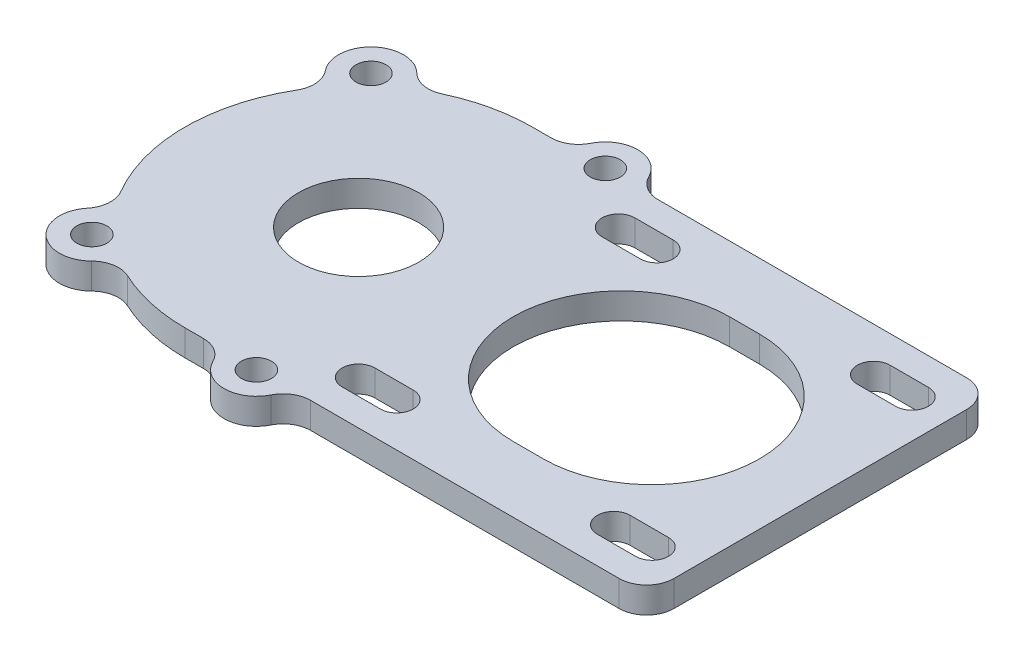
ISO-10303-21;
HEADER;
FILE_DESCRIPTION(('STEP AP214'),'2;1');
FILE_NAME('part.step','',(''),(''),'','','');
FILE_SCHEMA(('AUTOMOTIVE_DESIGN { 1 0 10303 214 1 1 1 1 }'));
ENDSEC;
DATA;
#1=APPLICATION_CONTEXT('core data for automotive mechanical design processes');
#2=APPLICATION_PROTOCOL_DEFINITION('international standard','automotive_design',2000,#1);
#3=PRODUCT_CONTEXT('',#1,'mechanical');
#4=PRODUCT('Part','Part','',(#3));
#5=PRODUCT_RELATED_PRODUCT_CATEGORY('part','',(#4));
#6=PRODUCT_DEFINITION_FORMATION('','',#4);
#7=PRODUCT_DEFINITION_CONTEXT('part definition',#1,'design');
#8=PRODUCT_DEFINITION('design','',#6,#7);
#9=PRODUCT_DEFINITION_SHAPE('','',#8);
#10=(LENGTH_UNIT() NAMED_UNIT(*) SI_UNIT(.MILLI.,.METRE.));
#11=(NAMED_UNIT(*) PLANE_ANGLE_UNIT() SI_UNIT($,.RADIAN.));
#12=(NAMED_UNIT(*) SI_UNIT($,.STERADIAN.) SOLID_ANGLE_UNIT());
#13=UNCERTAINTY_MEASURE_WITH_UNIT(LENGTH_MEASURE(1.E-05),#10,'distance_accuracy_value','');
#14=(GEOMETRIC_REPRESENTATION_CONTEXT(3) GLOBAL_UNCERTAINTY_ASSIGNED_CONTEXT((#13)) GLOBAL_UNIT_ASSIGNED_CONTEXT((#10,
#11,#12)) REPRESENTATION_CONTEXT('',''));
#15=CARTESIAN_POINT('',(0.,0.,0.));
#16=DIRECTION('',(0.,0.,1.));
#17=DIRECTION('',(1.,0.,0.));
#18=AXIS2_PLACEMENT_3D('',#15,#16,#17);
#19=CARTESIAN_POINT('',(-14.0127130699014,4.7625,31.875));
#20=DIRECTION('',(0.,1.,0.));
#21=DIRECTION('',(0.,0.,1.));
#22=AXIS2_PLACEMENT_3D('',#19,#20,#21);
#23=PLANE('',#22);
#24=CARTESIAN_POINT('',(-50.4504000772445,4.7625,-25.5));
#25=DIRECTION('',(0.,1.,0.));
#26=DIRECTION('',(0.,0.,1.));
#27=AXIS2_PLACEMENT_3D('',#24,#25,#26);
#28=CIRCLE('',#27,2.75);
#29=CARTESIAN_POINT('',(-50.4504000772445,4.7625,-28.25));
#30=VERTEX_POINT('',#29);
#31=EDGE_CURVE('E1179',#30,#30,#28,.T.);
#32=ORIENTED_EDGE('',*,*,#31,.F.);
#33=EDGE_LOOP('',(#32));
#34=FACE_BOUND('',#33,.T.);
#35=CARTESIAN_POINT('',(-14.0127130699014,4.7625,31.875));
#36=DIRECTION('',(0.,1.,0.));
#37=DIRECTION('',(0.,0.,1.));
#38=AXIS2_PLACEMENT_3D('',#35,#36,#37);
#39=CIRCLE('',#38,2.75);
#40=CARTESIAN_POINT('',(-14.0127130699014,4.7625,29.125));
#41=VERTEX_POINT('',#40);
#42=EDGE_CURVE('E334',#41,#41,#39,.T.);
#43=ORIENTED_EDGE('',*,*,#42,.F.);
#44=EDGE_LOOP('',(#43));
#45=FACE_BOUND('',#44,.T.);
#46=DIRECTION('',(-1.,0.,0.));
#47=VECTOR('',#46,1.);
#48=CARTESIAN_POINT('',(3.51858309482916,4.7625,-26.75));
#49=LINE('',#48,#47);
#50=CARTESIAN_POINT('',(3.51858309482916,4.7625,-26.75));
#51=VERTEX_POINT('',#50);
#52=CARTESIAN_POINT('',(-3.48141690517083,4.7625,-26.75));
#53=VERTEX_POINT('',#52);
#54=EDGE_CURVE('E347',#51,#53,#49,.T.);
#55=ORIENTED_EDGE('',*,*,#54,.F.);
#56=CARTESIAN_POINT('',(3.51858309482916,4.7625,-23.75));
#57=DIRECTION('',(0.,1.,0.));
#58=DIRECTION('',(0.,0.,1.));
#59=AXIS2_PLACEMENT_3D('',#56,#57,#58);
#60=CIRCLE('',#59,3.);
#61=CARTESIAN_POINT('',(3.51858309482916,4.7625,-20.75));
#62=VERTEX_POINT('',#61);
#63=EDGE_CURVE('E345',#62,#51,#60,.T.);
#64=ORIENTED_EDGE('',*,*,#63,.F.);
#65=DIRECTION('',(1.,0.,0.));
#66=VECTOR('',#65,1.);
#67=CARTESIAN_POINT('',(3.51858309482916,4.7625,-20.75));
#68=LINE('',#67,#66);
#69=CARTESIAN_POINT('',(-3.48141690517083,4.7625,-20.75));
#70=VERTEX_POINT('',#69);
#71=EDGE_CURVE('E353',#70,#62,#68,.T.);
#72=ORIENTED_EDGE('',*,*,#71,.F.);
#73=CARTESIAN_POINT('',(-3.48141690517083,4.7625,-23.75));
#74=DIRECTION('',(0.,1.,0.));
#75=DIRECTION('',(0.,0.,1.));
#76=AXIS2_PLACEMENT_3D('',#73,#74,#75);
#77=CIRCLE('',#76,3.);
#78=EDGE_CURVE('E350',#53,#70,#77,.T.);
#79=ORIENTED_EDGE('',*,*,#78,.F.);
#80=EDGE_LOOP('',(#55,#64,#72,#79));
#81=FACE_BOUND('',#80,.T.);
#82=DIRECTION('',(-1.,0.,0.));
#83=VECTOR('',#82,1.);
#84=CARTESIAN_POINT('',(50.15,4.7625,-26.75));
#85=LINE('',#84,#83);
#86=CARTESIAN_POINT('',(50.15,4.7625,-26.75));
#87=VERTEX_POINT('',#86);
#88=CARTESIAN_POINT('',(43.15,4.7625,-26.75));
#89=VERTEX_POINT('',#88);
#90=EDGE_CURVE('E409',#87,#89,#85,.T.);
#91=ORIENTED_EDGE('',*,*,#90,.F.);
#92=CARTESIAN_POINT('',(50.15,4.7625,-23.75));
#93=DIRECTION('',(0.,1.,0.));
#94=DIRECTION('',(0.,0.,1.));
#95=AXIS2_PLACEMENT_3D('',#92,#93,#94);
#96=CIRCLE('',#95,3.00000000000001);
#97=CARTESIAN_POINT('',(50.15,4.7625,-20.75));
#98=VERTEX_POINT('',#97);
#99=EDGE_CURVE('E407',#98,#87,#96,.T.);
#100=ORIENTED_EDGE('',*,*,#99,.F.);
#101=DIRECTION('',(1.,0.,0.));
#102=VECTOR('',#101,1.);
#103=CARTESIAN_POINT('',(50.15,4.7625,-20.75));
#104=LINE('',#103,#102);
#105=CARTESIAN_POINT('',(43.15,4.7625,-20.75));
#106=VERTEX_POINT('',#105);
#107=EDGE_CURVE('E415',#106,#98,#104,.T.);
#108=ORIENTED_EDGE('',*,*,#107,.F.);
#109=CARTESIAN_POINT('',(43.15,4.7625,-23.75));
#110=DIRECTION('',(0.,1.,0.));
#111=DIRECTION('',(0.,0.,1.));
#112=AXIS2_PLACEMENT_3D('',#109,#110,#111);
#113=CIRCLE('',#112,3.);
#114=EDGE_CURVE('E412',#89,#106,#113,.T.);
#115=ORIENTED_EDGE('',*,*,#114,.F.);
#116=EDGE_LOOP('',(#91,#100,#108,#115));
#117=FACE_BOUND('',#116,.T.);
#118=DIRECTION('',(-1.,0.,0.));
#119=VECTOR('',#118,1.);
#120=CARTESIAN_POINT('',(26.2875,4.7625,-19.75));
#121=LINE('',#120,#119);
#122=CARTESIAN_POINT('',(26.2875,4.7625,-19.75));
#123=VERTEX_POINT('',#122);
#124=CARTESIAN_POINT('',(20.7875,4.7625,-19.75));
#125=VERTEX_POINT('',#124);
#126=EDGE_CURVE('E446',#123,#125,#121,.T.);
#127=ORIENTED_EDGE('',*,*,#126,.F.);
#128=CARTESIAN_POINT('',(26.2875,4.7625,0.));
#129=DIRECTION('',(0.,1.,0.));
#130=DIRECTION('',(0.,0.,1.));
#131=AXIS2_PLACEMENT_3D('',#128,#129,#130);
#132=CIRCLE('',#131,19.75);
#133=CARTESIAN_POINT('',(26.2875,4.7625,19.75));
#134=VERTEX_POINT('',#133);
#135=EDGE_CURVE('E444',#134,#123,#132,.T.);
#136=ORIENTED_EDGE('',*,*,#135,.F.);
#137=DIRECTION('',(1.,0.,0.));
#138=VECTOR('',#137,1.);
#139=CARTESIAN_POINT('',(26.2875,4.7625,19.75));
#140=LINE('',#139,#138);
#141=CARTESIAN_POINT('',(20.7875,4.7625,19.75));
#142=VERTEX_POINT('',#141);
#143=EDGE_CURVE('E452',#142,#134,#140,.T.);
#144=ORIENTED_EDGE('',*,*,#143,.F.);
#145=CARTESIAN_POINT('',(20.7875,4.7625,0.));
#146=DIRECTION('',(0.,1.,0.));
#147=DIRECTION('',(0.,0.,1.));
#148=AXIS2_PLACEMENT_3D('',#145,#146,#147);
#149=CIRCLE('',#148,19.75);
#150=EDGE_CURVE('E449',#125,#142,#149,.T.);
#151=ORIENTED_EDGE('',*,*,#150,.F.);
#152=EDGE_LOOP('',(#127,#136,#144,#151));
#153=FACE_BOUND('',#152,.T.);
#154=DIRECTION('',(1.,0.,0.));
#155=VECTOR('',#154,1.);
#156=CARTESIAN_POINT('',(-8.08903178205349,4.7625,31.75));
#157=LINE('',#156,#155);
#158=CARTESIAN_POINT('',(-4.2356992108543,4.7625,31.75));
#159=VERTEX_POINT('',#158);
#160=CARTESIAN_POINT('',(52.15,4.7625,31.75));
#161=VERTEX_POINT('',#160);
#162=EDGE_CURVE('E502',#159,#161,#157,.T.);
#163=ORIENTED_EDGE('',*,*,#162,.T.);
#164=CARTESIAN_POINT('',(52.15,4.7625,26.75));
#165=DIRECTION('',(0.,1.,0.));
#166=DIRECTION('',(0.,0.,1.));
#167=AXIS2_PLACEMENT_3D('',#164,#165,#166);
#168=CIRCLE('',#167,5.);
#169=CARTESIAN_POINT('',(57.15,4.7625,26.75));
#170=VERTEX_POINT('',#169);
#171=EDGE_CURVE('E561',#161,#170,#168,.T.);
#172=ORIENTED_EDGE('',*,*,#171,.T.);
#173=DIRECTION('',(0.,0.,-1.));
#174=VECTOR('',#173,1.);
#175=CARTESIAN_POINT('',(57.15,4.7625,31.75));
#176=LINE('',#175,#174);
#177=CARTESIAN_POINT('',(57.15,4.7625,-26.75));
#178=VERTEX_POINT('',#177);
#179=EDGE_CURVE('E505',#170,#178,#176,.T.);
#180=ORIENTED_EDGE('',*,*,#179,.T.);
#181=CARTESIAN_POINT('',(52.15,4.7625,-26.75));
#182=DIRECTION('',(0.,1.,0.));
#183=DIRECTION('',(0.,0.,1.));
#184=AXIS2_PLACEMENT_3D('',#181,#182,#183);
#185=CIRCLE('',#184,5.);
#186=CARTESIAN_POINT('',(52.15,4.7625,-31.75));
#187=VERTEX_POINT('',#186);
#188=EDGE_CURVE('E559',#178,#187,#185,.T.);
#189=ORIENTED_EDGE('',*,*,#188,.T.);
#190=DIRECTION('',(-1.,0.,0.));
#191=VECTOR('',#190,1.);
#192=CARTESIAN_POINT('',(-8.08903178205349,4.7625,-31.75));
#193=LINE('',#192,#191);
#194=CARTESIAN_POINT('',(-4.23569921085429,4.7625,-31.75));
#195=VERTEX_POINT('',#194);
#196=EDGE_CURVE('E475',#187,#195,#193,.T.);
#197=ORIENTED_EDGE('',*,*,#196,.T.);
#198=CARTESIAN_POINT('',(-4.23569921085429,4.7625,-36.75));
#199=DIRECTION('',(0.,1.,0.));
#200=DIRECTION('',(0.,0.,1.));
#201=AXIS2_PLACEMENT_3D('',#198,#199,#200);
#202=CIRCLE('',#201,5.);
#203=CARTESIAN_POINT('',(-8.71030509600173,4.7625,-34.5188787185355));
#204=VERTEX_POINT('',#203);
#205=EDGE_CURVE('E604',#195,#204,#202,.F.);
#206=ORIENTED_EDGE('',*,*,#205,.T.);
#207=CARTESIAN_POINT('',(-14.0127130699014,4.7625,-31.875));
#208=DIRECTION('',(0.,1.,0.));
#209=DIRECTION('',(0.,0.,1.));
#210=AXIS2_PLACEMENT_3D('',#207,#208,#209);
#211=CIRCLE('',#210,5.925);
#212=CARTESIAN_POINT('',(-19.3151210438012,4.7625,-34.5188787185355));
#213=VERTEX_POINT('',#212);
#214=EDGE_CURVE('E478',#204,#213,#211,.T.);
#215=ORIENTED_EDGE('',*,*,#214,.T.);
#216=CARTESIAN_POINT('',(-23.7897269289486,4.7625,-36.75));
#217=DIRECTION('',(0.,1.,0.));
#218=DIRECTION('',(0.,0.,1.));
#219=AXIS2_PLACEMENT_3D('',#216,#217,#218);
#220=CIRCLE('',#219,5.);
#221=CARTESIAN_POINT('',(-23.7897269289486,4.7625,-31.75));
#222=VERTEX_POINT('',#221);
#223=EDGE_CURVE('E608',#213,#222,#220,.F.);
#224=ORIENTED_EDGE('',*,*,#223,.T.);
#225=DIRECTION('',(-1.,0.,0.));
#226=VECTOR('',#225,1.);
#227=CARTESIAN_POINT('',(-27.2125,4.7625,-31.75));
#228=LINE('',#227,#226);
#229=CARTESIAN_POINT('',(-27.2125,4.7625,-31.75));
#230=VERTEX_POINT('',#229);
#231=EDGE_CURVE('E482',#222,#230,#228,.T.);
#232=ORIENTED_EDGE('',*,*,#231,.T.);
#233=CARTESIAN_POINT('',(-27.2125,4.7625,0.));
#234=DIRECTION('',(0.,1.,0.));
#235=DIRECTION('',(0.,0.,1.));
#236=AXIS2_PLACEMENT_3D('',#233,#234,#235);
#237=CIRCLE('',#236,31.75);
#238=CARTESIAN_POINT('',(-40.668140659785,4.7625,-28.7577508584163));
#239=VERTEX_POINT('',#238);
#240=EDGE_CURVE('E484',#230,#239,#237,.T.);
#241=ORIENTED_EDGE('',*,*,#240,.T.);
#242=CARTESIAN_POINT('',(-42.787139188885,4.7625,-33.286530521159));
#243=DIRECTION('',(0.,1.,0.));
#244=DIRECTION('',(0.,0.,1.));
#245=AXIS2_PLACEMENT_3D('',#242,#243,#244);
#246=CIRCLE('',#245,5.);
#247=CARTESIAN_POINT('',(-46.2943524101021,4.7625,-29.7229009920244));
#248=VERTEX_POINT('',#247);
#249=EDGE_CURVE('E612',#239,#248,#246,.F.);
#250=ORIENTED_EDGE('',*,*,#249,.T.);
#251=CARTESIAN_POINT('',(-50.4504000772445,4.7625,-25.5));
#252=DIRECTION('',(0.,1.,0.));
#253=DIRECTION('',(0.,0.,1.));
#254=AXIS2_PLACEMENT_3D('',#251,#252,#253);
#255=CIRCLE('',#254,5.92500000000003);
#256=CARTESIAN_POINT('',(-55.0401107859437,4.7625,-21.7529771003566));
#257=VERTEX_POINT('',#256);
#258=EDGE_CURVE('E487',#248,#257,#255,.T.);
#259=ORIENTED_EDGE('',*,*,#258,.T.);
#260=CARTESIAN_POINT('',(-58.9132843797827,4.7625,-18.5909324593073));
#261=DIRECTION('',(0.,1.,0.));
#262=DIRECTION('',(0.,0.,1.));
#263=AXIS2_PLACEMENT_3D('',#260,#261,#262);
#264=CIRCLE('',#263,5.);
#265=CARTESIAN_POINT('',(-54.6002524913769,4.7625,-16.0615538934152));
#266=VERTEX_POINT('',#265);
#267=EDGE_CURVE('E616',#257,#266,#264,.F.);
#268=ORIENTED_EDGE('',*,*,#267,.T.);
#269=CARTESIAN_POINT('',(-27.2125,4.7625,0.));
#270=DIRECTION('',(0.,1.,0.));
#271=DIRECTION('',(0.,0.,1.));
#272=AXIS2_PLACEMENT_3D('',#269,#270,#271);
#273=CIRCLE('',#272,31.75);
#274=CARTESIAN_POINT('',(-54.6002524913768,4.7625,16.0615538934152));
#275=VERTEX_POINT('',#274);
#276=EDGE_CURVE('E490',#266,#275,#273,.T.);
#277=ORIENTED_EDGE('',*,*,#276,.T.);
#278=CARTESIAN_POINT('',(-58.9132843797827,4.7625,18.5909324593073));
#279=DIRECTION('',(0.,1.,0.));
#280=DIRECTION('',(0.,0.,1.));
#281=AXIS2_PLACEMENT_3D('',#278,#279,#280);
#282=CIRCLE('',#281,5.);
#283=CARTESIAN_POINT('',(-55.0401107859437,4.7625,21.7529771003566));
#284=VERTEX_POINT('',#283);
#285=EDGE_CURVE('E620',#275,#284,#282,.F.);
#286=ORIENTED_EDGE('',*,*,#285,.T.);
#287=CARTESIAN_POINT('',(-50.4504000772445,4.7625,25.5));
#288=DIRECTION('',(0.,1.,0.));
#289=DIRECTION('',(0.,0.,1.));
#290=AXIS2_PLACEMENT_3D('',#287,#288,#289);
#291=CIRCLE('',#290,5.925);
#292=CARTESIAN_POINT('',(-46.2943524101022,4.7625,29.7229009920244));
#293=VERTEX_POINT('',#292);
#294=EDGE_CURVE('E493',#284,#293,#291,.T.);
#295=ORIENTED_EDGE('',*,*,#294,.T.);
#296=CARTESIAN_POINT('',(-42.787139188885,4.7625,33.2865305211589));
#297=DIRECTION('',(0.,1.,0.));
#298=DIRECTION('',(0.,0.,1.));
#299=AXIS2_PLACEMENT_3D('',#296,#297,#298);
#300=CIRCLE('',#299,5.);
#301=CARTESIAN_POINT('',(-40.668140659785,4.7625,28.7577508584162));
#302=VERTEX_POINT('',#301);
#303=EDGE_CURVE('E624',#293,#302,#300,.F.);
#304=ORIENTED_EDGE('',*,*,#303,.T.);
#305=CARTESIAN_POINT('',(-27.2125,4.7625,0.));
#306=DIRECTION('',(0.,1.,0.));
#307=DIRECTION('',(0.,0.,1.));
#308=AXIS2_PLACEMENT_3D('',#305,#306,#307);
#309=CIRCLE('',#308,31.75);
#310=CARTESIAN_POINT('',(-27.2125,4.7625,31.75));
#311=VERTEX_POINT('',#310);
#312=EDGE_CURVE('E496',#302,#311,#309,.T.);
#313=ORIENTED_EDGE('',*,*,#312,.T.);
#314=DIRECTION('',(1.,0.,0.));
#315=VECTOR('',#314,1.);
#316=CARTESIAN_POINT('',(-27.2125,4.7625,31.75));
#317=LINE('',#316,#315);
#318=CARTESIAN_POINT('',(-23.7897269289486,4.7625,31.75));
#319=VERTEX_POINT('',#318);
#320=EDGE_CURVE('E498',#311,#319,#317,.T.);
#321=ORIENTED_EDGE('',*,*,#320,.T.);
#322=CARTESIAN_POINT('',(-23.7897269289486,4.7625,36.75));
#323=DIRECTION('',(0.,1.,0.));
#324=DIRECTION('',(0.,0.,1.));
#325=AXIS2_PLACEMENT_3D('',#322,#323,#324);
#326=CIRCLE('',#325,5.);
#327=CARTESIAN_POINT('',(-19.3151210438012,4.7625,34.5188787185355));
#328=VERTEX_POINT('',#327);
#329=EDGE_CURVE('E52',#319,#328,#326,.F.);
#330=ORIENTED_EDGE('',*,*,#329,.T.);
#331=CARTESIAN_POINT('',(-14.0127130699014,4.7625,31.875));
#332=DIRECTION('',(0.,1.,0.));
#333=DIRECTION('',(0.,0.,1.));
#334=AXIS2_PLACEMENT_3D('',#331,#332,#333);
#335=CIRCLE('',#334,5.925);
#336=CARTESIAN_POINT('',(-8.71030509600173,4.7625,34.5188787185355));
#337=VERTEX_POINT('',#336);
#338=EDGE_CURVE('E500',#328,#337,#335,.T.);
#339=ORIENTED_EDGE('',*,*,#338,.T.);
#340=CARTESIAN_POINT('',(-4.2356992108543,4.7625,36.75));
#341=DIRECTION('',(0.,1.,0.));
#342=DIRECTION('',(0.,0.,1.));
#343=AXIS2_PLACEMENT_3D('',#340,#341,#342);
#344=CIRCLE('',#343,5.);
#345=EDGE_CURVE('E11',#337,#159,#344,.F.);
#346=ORIENTED_EDGE('',*,*,#345,.T.);
#347=EDGE_LOOP('',(#163,#172,#180,#189,#197,#206,#215,#224,#232,#241,#250,#259,#268,#277,#286,
#295,#304,#313,#321,#330,#339,#346));
#348=FACE_BOUND('',#347,.T.);
#349=CARTESIAN_POINT('',(-27.2125,4.7625,0.));
#350=DIRECTION('',(0.,1.,0.));
#351=DIRECTION('',(0.,0.,1.));
#352=AXIS2_PLACEMENT_3D('',#349,#350,#351);
#353=CIRCLE('',#352,11.);
#354=CARTESIAN_POINT('',(-27.2125,4.7625,-11.));
#355=VERTEX_POINT('',#354);
#356=EDGE_CURVE('E438',#355,#355,#353,.T.);
#357=ORIENTED_EDGE('',*,*,#356,.F.);
#358=EDGE_LOOP('',(#357));
#359=FACE_BOUND('',#358,.T.);
#360=DIRECTION('',(-1.,0.,0.));
#361=VECTOR('',#360,1.);
#362=CARTESIAN_POINT('',(50.15,4.7625,20.75));
#363=LINE('',#362,#361);
#364=CARTESIAN_POINT('',(50.15,4.7625,20.75));
#365=VERTEX_POINT('',#364);
#366=CARTESIAN_POINT('',(43.15,4.7625,20.75));
#367=VERTEX_POINT('',#366);
#368=EDGE_CURVE('E378',#365,#367,#363,.T.);
#369=ORIENTED_EDGE('',*,*,#368,.F.);
#370=CARTESIAN_POINT('',(50.15,4.7625,23.75));
#371=DIRECTION('',(0.,1.,0.));
#372=DIRECTION('',(0.,0.,-1.));
#373=AXIS2_PLACEMENT_3D('',#370,#371,#372);
#374=CIRCLE('',#373,3.00000000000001);
#375=CARTESIAN_POINT('',(50.15,4.7625,26.75));
#376=VERTEX_POINT('',#375);
#377=EDGE_CURVE('E376',#376,#365,#374,.T.);
#378=ORIENTED_EDGE('',*,*,#377,.F.);
#379=DIRECTION('',(1.,0.,0.));
#380=VECTOR('',#379,1.);
#381=CARTESIAN_POINT('',(50.15,4.7625,26.75));
#382=LINE('',#381,#380);
#383=CARTESIAN_POINT('',(43.15,4.7625,26.75));
#384=VERTEX_POINT('',#383);
#385=EDGE_CURVE('E384',#384,#376,#382,.T.);
#386=ORIENTED_EDGE('',*,*,#385,.F.);
#387=CARTESIAN_POINT('',(43.15,4.7625,23.75));
#388=DIRECTION('',(0.,1.,0.));
#389=DIRECTION('',(0.,0.,-1.));
#390=AXIS2_PLACEMENT_3D('',#387,#388,#389);
#391=CIRCLE('',#390,3.);
#392=EDGE_CURVE('E381',#367,#384,#391,.T.);
#393=ORIENTED_EDGE('',*,*,#392,.F.);
#394=EDGE_LOOP('',(#369,#378,#386,#393));
#395=FACE_BOUND('',#394,.T.);
#396=DIRECTION('',(-1.,0.,0.));
#397=VECTOR('',#396,1.);
#398=CARTESIAN_POINT('',(3.51858309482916,4.7625,20.75));
#399=LINE('',#398,#397);
#400=CARTESIAN_POINT('',(3.51858309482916,4.7625,20.75));
#401=VERTEX_POINT('',#400);
#402=CARTESIAN_POINT('',(-3.48141690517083,4.7625,20.75));
#403=VERTEX_POINT('',#402);
#404=EDGE_CURVE('E311',#401,#403,#399,.T.);
#405=ORIENTED_EDGE('',*,*,#404,.F.);
#406=CARTESIAN_POINT('',(3.51858309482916,4.7625,23.75));
#407=DIRECTION('',(0.,1.,0.));
#408=DIRECTION('',(0.,0.,-1.));
#409=AXIS2_PLACEMENT_3D('',#406,#407,#408);
#410=CIRCLE('',#409,3.00000000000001);
#411=CARTESIAN_POINT('',(3.51858309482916,4.7625,26.75));
#412=VERTEX_POINT('',#411);
#413=EDGE_CURVE('E301',#412,#401,#410,.T.);
#414=ORIENTED_EDGE('',*,*,#413,.F.);
#415=DIRECTION('',(1.,0.,0.));
#416=VECTOR('',#415,1.);
#417=CARTESIAN_POINT('',(3.51858309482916,4.7625,26.75));
#418=LINE('',#417,#416);
#419=CARTESIAN_POINT('',(-3.48141690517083,4.7625,26.75));
#420=VERTEX_POINT('',#419);
#421=EDGE_CURVE('E327',#420,#412,#418,.T.);
#422=ORIENTED_EDGE('',*,*,#421,.F.);
#423=CARTESIAN_POINT('',(-3.48141690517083,4.7625,23.75));
#424=DIRECTION('',(0.,1.,0.));
#425=DIRECTION('',(0.,0.,-1.));
#426=AXIS2_PLACEMENT_3D('',#423,#424,#425);
#427=CIRCLE('',#426,3.);
#428=EDGE_CURVE('E325',#403,#420,#427,.T.);
#429=ORIENTED_EDGE('',*,*,#428,.F.);
#430=EDGE_LOOP('',(#405,#414,#422,#429));
#431=FACE_BOUND('',#430,.T.);
#432=CARTESIAN_POINT('',(-14.0127130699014,4.7625,-31.875));
#433=DIRECTION('',(0.,1.,0.));
#434=DIRECTION('',(0.,0.,1.));
#435=AXIS2_PLACEMENT_3D('',#432,#433,#434);
#436=CIRCLE('',#435,2.75);
#437=CARTESIAN_POINT('',(-14.0127130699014,4.7625,-34.625));
#438=VERTEX_POINT('',#437);
#439=EDGE_CURVE('E1185',#438,#438,#436,.T.);
#440=ORIENTED_EDGE('',*,*,#439,.F.);
#441=EDGE_LOOP('',(#440));
#442=FACE_BOUND('',#441,.T.);
#443=CARTESIAN_POINT('',(-50.4504000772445,4.7625,25.5));
#444=DIRECTION('',(0.,1.,0.));
#445=DIRECTION('',(0.,0.,1.));
#446=AXIS2_PLACEMENT_3D('',#443,#444,#445);
#447=CIRCLE('',#446,2.75);
#448=CARTESIAN_POINT('',(-50.4504000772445,4.7625,22.75));
#449=VERTEX_POINT('',#448);
#450=EDGE_CURVE('E1170',#449,#449,#447,.T.);
#451=ORIENTED_EDGE('',*,*,#450,.F.);
#452=EDGE_LOOP('',(#451));
#453=FACE_BOUND('',#452,.T.);
#454=ADVANCED_FACE('F30',(#34,#45,#81,#117,#153,#348,#359,#395,#431,#442,#453),#23,.T.);
#455=CARTESIAN_POINT('',(-14.0127130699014,0.,31.875));
#456=DIRECTION('',(0.,1.,0.));
#457=DIRECTION('',(0.,0.,1.));
#458=AXIS2_PLACEMENT_3D('',#455,#456,#457);
#459=PLANE('',#458);
#460=CARTESIAN_POINT('',(-50.4504000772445,0.,-25.5));
#461=DIRECTION('',(0.,1.,0.));
#462=DIRECTION('',(0.,0.,1.));
#463=AXIS2_PLACEMENT_3D('',#460,#461,#462);
#464=CIRCLE('',#463,2.75);
#465=CARTESIAN_POINT('',(-50.4504000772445,0.,-28.25));
#466=VERTEX_POINT('',#465);
#467=EDGE_CURVE('E1176',#466,#466,#464,.T.);
#468=ORIENTED_EDGE('',*,*,#467,.T.);
#469=EDGE_LOOP('',(#468));
#470=FACE_BOUND('',#469,.T.);
#471=CARTESIAN_POINT('',(-14.0127130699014,0.,31.875));
#472=DIRECTION('',(0.,1.,0.));
#473=DIRECTION('',(0.,0.,1.));
#474=AXIS2_PLACEMENT_3D('',#471,#472,#473);
#475=CIRCLE('',#474,2.75);
#476=CARTESIAN_POINT('',(-14.0127130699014,0.,29.125));
#477=VERTEX_POINT('',#476);
#478=EDGE_CURVE('E1188',#477,#477,#475,.T.);
#479=ORIENTED_EDGE('',*,*,#478,.T.);
#480=EDGE_LOOP('',(#479));
#481=FACE_BOUND('',#480,.T.);
#482=CARTESIAN_POINT('',(3.51858309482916,0.,-23.75));
#483=DIRECTION('',(0.,1.,0.));
#484=DIRECTION('',(0.,0.,1.));
#485=AXIS2_PLACEMENT_3D('',#482,#483,#484);
#486=CIRCLE('',#485,3.);
#487=CARTESIAN_POINT('',(3.51858309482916,0.,-20.75));
#488=VERTEX_POINT('',#487);
#489=CARTESIAN_POINT('',(3.51858309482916,0.,-26.75));
#490=VERTEX_POINT('',#489);
#491=EDGE_CURVE('E319',#488,#490,#486,.T.);
#492=ORIENTED_EDGE('',*,*,#491,.T.);
#493=DIRECTION('',(-1.,0.,0.));
#494=VECTOR('',#493,1.);
#495=CARTESIAN_POINT('',(3.51858309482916,0.,-26.75));
#496=LINE('',#495,#494);
#497=CARTESIAN_POINT('',(-3.48141690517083,0.,-26.75));
#498=VERTEX_POINT('',#497);
#499=EDGE_CURVE('E358',#490,#498,#496,.T.);
#500=ORIENTED_EDGE('',*,*,#499,.T.);
#501=CARTESIAN_POINT('',(-3.48141690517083,0.,-23.75));
#502=DIRECTION('',(0.,1.,0.));
#503=DIRECTION('',(0.,0.,1.));
#504=AXIS2_PLACEMENT_3D('',#501,#502,#503);
#505=CIRCLE('',#504,3.);
#506=CARTESIAN_POINT('',(-3.48141690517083,0.,-20.75));
#507=VERTEX_POINT('',#506);
#508=EDGE_CURVE('E361',#498,#507,#505,.T.);
#509=ORIENTED_EDGE('',*,*,#508,.T.);
#510=DIRECTION('',(1.,0.,0.));
#511=VECTOR('',#510,1.);
#512=CARTESIAN_POINT('',(3.51858309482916,0.,-20.75));
#513=LINE('',#512,#511);
#514=EDGE_CURVE('E348',#507,#488,#513,.T.);
#515=ORIENTED_EDGE('',*,*,#514,.T.);
#516=EDGE_LOOP('',(#492,#500,#509,#515));
#517=FACE_BOUND('',#516,.T.);
#518=CARTESIAN_POINT('',(50.15,0.,-23.75));
#519=DIRECTION('',(0.,1.,0.));
#520=DIRECTION('',(0.,0.,1.));
#521=AXIS2_PLACEMENT_3D('',#518,#519,#520);
#522=CIRCLE('',#521,3.00000000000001);
#523=CARTESIAN_POINT('',(50.15,0.,-20.75));
#524=VERTEX_POINT('',#523);
#525=CARTESIAN_POINT('',(50.15,0.,-26.75));
#526=VERTEX_POINT('',#525);
#527=EDGE_CURVE('E406',#524,#526,#522,.T.);
#528=ORIENTED_EDGE('',*,*,#527,.T.);
#529=DIRECTION('',(-1.,0.,0.));
#530=VECTOR('',#529,1.);
#531=CARTESIAN_POINT('',(50.15,0.,-26.75));
#532=LINE('',#531,#530);
#533=CARTESIAN_POINT('',(43.15,0.,-26.75));
#534=VERTEX_POINT('',#533);
#535=EDGE_CURVE('E420',#526,#534,#532,.T.);
#536=ORIENTED_EDGE('',*,*,#535,.T.);
#537=CARTESIAN_POINT('',(43.15,0.,-23.75));
#538=DIRECTION('',(0.,1.,0.));
#539=DIRECTION('',(0.,0.,1.));
#540=AXIS2_PLACEMENT_3D('',#537,#538,#539);
#541=CIRCLE('',#540,3.);
#542=CARTESIAN_POINT('',(43.15,0.,-20.75));
#543=VERTEX_POINT('',#542);
#544=EDGE_CURVE('E423',#534,#543,#541,.T.);
#545=ORIENTED_EDGE('',*,*,#544,.T.);
#546=DIRECTION('',(1.,0.,0.));
#547=VECTOR('',#546,1.);
#548=CARTESIAN_POINT('',(50.15,0.,-20.75));
#549=LINE('',#548,#547);
#550=EDGE_CURVE('E410',#543,#524,#549,.T.);
#551=ORIENTED_EDGE('',*,*,#550,.T.);
#552=EDGE_LOOP('',(#528,#536,#545,#551));
#553=FACE_BOUND('',#552,.T.);
#554=CARTESIAN_POINT('',(26.2875,0.,0.));
#555=DIRECTION('',(0.,1.,0.));
#556=DIRECTION('',(0.,0.,1.));
#557=AXIS2_PLACEMENT_3D('',#554,#555,#556);
#558=CIRCLE('',#557,19.75);
#559=CARTESIAN_POINT('',(26.2875,0.,19.75));
#560=VERTEX_POINT('',#559);
#561=CARTESIAN_POINT('',(26.2875,0.,-19.75));
#562=VERTEX_POINT('',#561);
#563=EDGE_CURVE('E441',#560,#562,#558,.T.);
#564=ORIENTED_EDGE('',*,*,#563,.T.);
#565=DIRECTION('',(-1.,0.,0.));
#566=VECTOR('',#565,1.);
#567=CARTESIAN_POINT('',(26.2875,0.,-19.75));
#568=LINE('',#567,#566);
#569=CARTESIAN_POINT('',(20.7875,0.,-19.75));
#570=VERTEX_POINT('',#569);
#571=EDGE_CURVE('E457',#562,#570,#568,.T.);
#572=ORIENTED_EDGE('',*,*,#571,.T.);
#573=CARTESIAN_POINT('',(20.7875,0.,0.));
#574=DIRECTION('',(0.,1.,0.));
#575=DIRECTION('',(0.,0.,1.));
#576=AXIS2_PLACEMENT_3D('',#573,#574,#575);
#577=CIRCLE('',#576,19.75);
#578=CARTESIAN_POINT('',(20.7875,0.,19.75));
#579=VERTEX_POINT('',#578);
#580=EDGE_CURVE('E460',#570,#579,#577,.T.);
#581=ORIENTED_EDGE('',*,*,#580,.T.);
#582=DIRECTION('',(1.,0.,0.));
#583=VECTOR('',#582,1.);
#584=CARTESIAN_POINT('',(26.2875,0.,19.75));
#585=LINE('',#584,#583);
#586=EDGE_CURVE('E447',#579,#560,#585,.T.);
#587=ORIENTED_EDGE('',*,*,#586,.T.);
#588=EDGE_LOOP('',(#564,#572,#581,#587));
#589=FACE_BOUND('',#588,.T.);
#590=DIRECTION('',(0.,0.,-1.));
#591=VECTOR('',#590,1.);
#592=CARTESIAN_POINT('',(57.15,0.,31.75));
#593=LINE('',#592,#591);
#594=CARTESIAN_POINT('',(57.15,0.,26.75));
#595=VERTEX_POINT('',#594);
#596=CARTESIAN_POINT('',(57.15,0.,-26.75));
#597=VERTEX_POINT('',#596);
#598=EDGE_CURVE('E479',#595,#597,#593,.T.);
#599=ORIENTED_EDGE('',*,*,#598,.F.);
#600=CARTESIAN_POINT('',(52.15,0.,26.75));
#601=DIRECTION('',(0.,1.,0.));
#602=DIRECTION('',(0.,0.,1.));
#603=AXIS2_PLACEMENT_3D('',#600,#601,#602);
#604=CIRCLE('',#603,5.);
#605=CARTESIAN_POINT('',(52.15,0.,31.75));
#606=VERTEX_POINT('',#605);
#607=EDGE_CURVE('E552',#595,#606,#604,.F.);
#608=ORIENTED_EDGE('',*,*,#607,.T.);
#609=DIRECTION('',(1.,0.,0.));
#610=VECTOR('',#609,1.);
#611=CARTESIAN_POINT('',(-8.08903178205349,0.,31.75));
#612=LINE('',#611,#610);
#613=CARTESIAN_POINT('',(-4.2356992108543,0.,31.75));
#614=VERTEX_POINT('',#613);
#615=EDGE_CURVE('E535',#614,#606,#612,.T.);
#616=ORIENTED_EDGE('',*,*,#615,.F.);
#617=CARTESIAN_POINT('',(-4.2356992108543,0.,36.75));
#618=DIRECTION('',(0.,1.,0.));
#619=DIRECTION('',(0.,0.,1.));
#620=AXIS2_PLACEMENT_3D('',#617,#618,#619);
#621=CIRCLE('',#620,5.);
#622=CARTESIAN_POINT('',(-8.71030509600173,0.,34.5188787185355));
#623=VERTEX_POINT('',#622);
#624=EDGE_CURVE('E38',#614,#623,#621,.T.);
#625=ORIENTED_EDGE('',*,*,#624,.T.);
#626=CARTESIAN_POINT('',(-14.0127130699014,0.,31.875));
#627=DIRECTION('',(0.,1.,0.));
#628=DIRECTION('',(0.,0.,1.));
#629=AXIS2_PLACEMENT_3D('',#626,#627,#628);
#630=CIRCLE('',#629,5.925);
#631=CARTESIAN_POINT('',(-19.3151210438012,0.,34.5188787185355));
#632=VERTEX_POINT('',#631);
#633=EDGE_CURVE('E533',#632,#623,#630,.T.);
#634=ORIENTED_EDGE('',*,*,#633,.F.);
#635=CARTESIAN_POINT('',(-23.7897269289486,0.,36.75));
#636=DIRECTION('',(0.,1.,0.));
#637=DIRECTION('',(0.,0.,1.));
#638=AXIS2_PLACEMENT_3D('',#635,#636,#637);
#639=CIRCLE('',#638,5.);
#640=CARTESIAN_POINT('',(-23.7897269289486,0.,31.75));
#641=VERTEX_POINT('',#640);
#642=EDGE_CURVE('E626',#632,#641,#639,.T.);
#643=ORIENTED_EDGE('',*,*,#642,.T.);
#644=DIRECTION('',(1.,0.,0.));
#645=VECTOR('',#644,1.);
#646=CARTESIAN_POINT('',(-27.2125,0.,31.75));
#647=LINE('',#646,#645);
#648=CARTESIAN_POINT('',(-27.2125,0.,31.75));
#649=VERTEX_POINT('',#648);
#650=EDGE_CURVE('E530',#649,#641,#647,.T.);
#651=ORIENTED_EDGE('',*,*,#650,.F.);
#652=CARTESIAN_POINT('',(-27.2125,0.,0.));
#653=DIRECTION('',(0.,1.,0.));
#654=DIRECTION('',(0.,0.,1.));
#655=AXIS2_PLACEMENT_3D('',#652,#653,#654);
#656=CIRCLE('',#655,31.75);
#657=CARTESIAN_POINT('',(-40.668140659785,0.,28.7577508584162));
#658=VERTEX_POINT('',#657);
#659=EDGE_CURVE('E528',#658,#649,#656,.T.);
#660=ORIENTED_EDGE('',*,*,#659,.F.);
#661=CARTESIAN_POINT('',(-42.787139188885,0.,33.2865305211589));
#662=DIRECTION('',(0.,1.,0.));
#663=DIRECTION('',(0.,0.,1.));
#664=AXIS2_PLACEMENT_3D('',#661,#662,#663);
#665=CIRCLE('',#664,5.);
#666=CARTESIAN_POINT('',(-46.2943524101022,0.,29.7229009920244));
#667=VERTEX_POINT('',#666);
#668=EDGE_CURVE('E622',#658,#667,#665,.T.);
#669=ORIENTED_EDGE('',*,*,#668,.T.);
#670=CARTESIAN_POINT('',(-50.4504000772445,0.,25.5));
#671=DIRECTION('',(0.,1.,0.));
#672=DIRECTION('',(0.,0.,1.));
#673=AXIS2_PLACEMENT_3D('',#670,#671,#672);
#674=CIRCLE('',#673,5.925);
#675=CARTESIAN_POINT('',(-55.0401107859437,0.,21.7529771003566));
#676=VERTEX_POINT('',#675);
#677=EDGE_CURVE('E525',#676,#667,#674,.T.);
#678=ORIENTED_EDGE('',*,*,#677,.F.);
#679=CARTESIAN_POINT('',(-58.9132843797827,0.,18.5909324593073));
#680=DIRECTION('',(0.,1.,0.));
#681=DIRECTION('',(0.,0.,1.));
#682=AXIS2_PLACEMENT_3D('',#679,#680,#681);
#683=CIRCLE('',#682,5.);
#684=CARTESIAN_POINT('',(-54.6002524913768,0.,16.0615538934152));
#685=VERTEX_POINT('',#684);
#686=EDGE_CURVE('E618',#676,#685,#683,.T.);
#687=ORIENTED_EDGE('',*,*,#686,.T.);
#688=CARTESIAN_POINT('',(-27.2125,0.,0.));
#689=DIRECTION('',(0.,1.,0.));
#690=DIRECTION('',(0.,0.,1.));
#691=AXIS2_PLACEMENT_3D('',#688,#689,#690);
#692=CIRCLE('',#691,31.75);
#693=CARTESIAN_POINT('',(-54.6002524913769,0.,-16.0615538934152));
#694=VERTEX_POINT('',#693);
#695=EDGE_CURVE('E522',#694,#685,#692,.T.);
#696=ORIENTED_EDGE('',*,*,#695,.F.);
#697=CARTESIAN_POINT('',(-58.9132843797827,0.,-18.5909324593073));
#698=DIRECTION('',(0.,1.,0.));
#699=DIRECTION('',(0.,0.,1.));
#700=AXIS2_PLACEMENT_3D('',#697,#698,#699);
#701=CIRCLE('',#700,5.);
#702=CARTESIAN_POINT('',(-55.0401107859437,0.,-21.7529771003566));
#703=VERTEX_POINT('',#702);
#704=EDGE_CURVE('E614',#694,#703,#701,.T.);
#705=ORIENTED_EDGE('',*,*,#704,.T.);
#706=CARTESIAN_POINT('',(-50.4504000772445,0.,-25.5));
#707=DIRECTION('',(0.,1.,0.));
#708=DIRECTION('',(0.,0.,1.));
#709=AXIS2_PLACEMENT_3D('',#706,#707,#708);
#710=CIRCLE('',#709,5.92500000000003);
#711=CARTESIAN_POINT('',(-46.2943524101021,0.,-29.7229009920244));
#712=VERTEX_POINT('',#711);
#713=EDGE_CURVE('E519',#712,#703,#710,.T.);
#714=ORIENTED_EDGE('',*,*,#713,.F.);
#715=CARTESIAN_POINT('',(-42.787139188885,0.,-33.286530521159));
#716=DIRECTION('',(0.,1.,0.));
#717=DIRECTION('',(0.,0.,1.));
#718=AXIS2_PLACEMENT_3D('',#715,#716,#717);
#719=CIRCLE('',#718,5.);
#720=CARTESIAN_POINT('',(-40.668140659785,0.,-28.7577508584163));
#721=VERTEX_POINT('',#720);
#722=EDGE_CURVE('E610',#712,#721,#719,.T.);
#723=ORIENTED_EDGE('',*,*,#722,.T.);
#724=CARTESIAN_POINT('',(-27.2125,0.,0.));
#725=DIRECTION('',(0.,1.,0.));
#726=DIRECTION('',(0.,0.,1.));
#727=AXIS2_PLACEMENT_3D('',#724,#725,#726);
#728=CIRCLE('',#727,31.75);
#729=CARTESIAN_POINT('',(-27.2125,0.,-31.75));
#730=VERTEX_POINT('',#729);
#731=EDGE_CURVE('E516',#730,#721,#728,.T.);
#732=ORIENTED_EDGE('',*,*,#731,.F.);
#733=DIRECTION('',(-1.,0.,0.));
#734=VECTOR('',#733,1.);
#735=CARTESIAN_POINT('',(-27.2125,0.,-31.75));
#736=LINE('',#735,#734);
#737=CARTESIAN_POINT('',(-23.7897269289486,0.,-31.75));
#738=VERTEX_POINT('',#737);
#739=EDGE_CURVE('E514',#738,#730,#736,.T.);
#740=ORIENTED_EDGE('',*,*,#739,.F.);
#741=CARTESIAN_POINT('',(-23.7897269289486,0.,-36.75));
#742=DIRECTION('',(0.,1.,0.));
#743=DIRECTION('',(0.,0.,1.));
#744=AXIS2_PLACEMENT_3D('',#741,#742,#743);
#745=CIRCLE('',#744,5.);
#746=CARTESIAN_POINT('',(-19.3151210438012,0.,-34.5188787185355));
#747=VERTEX_POINT('',#746);
#748=EDGE_CURVE('E606',#738,#747,#745,.T.);
#749=ORIENTED_EDGE('',*,*,#748,.T.);
#750=CARTESIAN_POINT('',(-14.0127130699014,0.,-31.875));
#751=DIRECTION('',(0.,1.,0.));
#752=DIRECTION('',(0.,0.,1.));
#753=AXIS2_PLACEMENT_3D('',#750,#751,#752);
#754=CIRCLE('',#753,5.925);
#755=CARTESIAN_POINT('',(-8.71030509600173,0.,-34.5188787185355));
#756=VERTEX_POINT('',#755);
#757=EDGE_CURVE('E511',#756,#747,#754,.T.);
#758=ORIENTED_EDGE('',*,*,#757,.F.);
#759=CARTESIAN_POINT('',(-4.23569921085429,0.,-36.75));
#760=DIRECTION('',(0.,1.,0.));
#761=DIRECTION('',(0.,0.,1.));
#762=AXIS2_PLACEMENT_3D('',#759,#760,#761);
#763=CIRCLE('',#762,5.);
#764=CARTESIAN_POINT('',(-4.23569921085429,0.,-31.75));
#765=VERTEX_POINT('',#764);
#766=EDGE_CURVE('E602',#756,#765,#763,.T.);
#767=ORIENTED_EDGE('',*,*,#766,.T.);
#768=DIRECTION('',(-1.,0.,0.));
#769=VECTOR('',#768,1.);
#770=CARTESIAN_POINT('',(-8.08903178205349,0.,-31.75));
#771=LINE('',#770,#769);
#772=CARTESIAN_POINT('',(52.15,0.,-31.75));
#773=VERTEX_POINT('',#772);
#774=EDGE_CURVE('E474',#773,#765,#771,.T.);
#775=ORIENTED_EDGE('',*,*,#774,.F.);
#776=CARTESIAN_POINT('',(52.15,0.,-26.75));
#777=DIRECTION('',(0.,1.,0.));
#778=DIRECTION('',(0.,0.,1.));
#779=AXIS2_PLACEMENT_3D('',#776,#777,#778);
#780=CIRCLE('',#779,5.);
#781=EDGE_CURVE('E550',#773,#597,#780,.F.);
#782=ORIENTED_EDGE('',*,*,#781,.T.);
#783=EDGE_LOOP('',(#599,#608,#616,#625,#634,#643,#651,#660,#669,#678,#687,#696,#705,#714,#723,
#732,#740,#749,#758,#767,#775,#782));
#784=FACE_BOUND('',#783,.T.);
#785=CARTESIAN_POINT('',(-27.2125,0.,0.));
#786=DIRECTION('',(0.,1.,0.));
#787=DIRECTION('',(0.,0.,1.));
#788=AXIS2_PLACEMENT_3D('',#785,#786,#787);
#789=CIRCLE('',#788,11.);
#790=CARTESIAN_POINT('',(-27.2125,0.,-11.));
#791=VERTEX_POINT('',#790);
#792=EDGE_CURVE('E437',#791,#791,#789,.T.);
#793=ORIENTED_EDGE('',*,*,#792,.T.);
#794=EDGE_LOOP('',(#793));
#795=FACE_BOUND('',#794,.T.);
#796=CARTESIAN_POINT('',(50.15,0.,23.75));
#797=DIRECTION('',(0.,1.,0.));
#798=DIRECTION('',(0.,0.,-1.));
#799=AXIS2_PLACEMENT_3D('',#796,#797,#798);
#800=CIRCLE('',#799,3.00000000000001);
#801=CARTESIAN_POINT('',(50.15,0.,26.75));
#802=VERTEX_POINT('',#801);
#803=CARTESIAN_POINT('',(50.15,0.,20.75));
#804=VERTEX_POINT('',#803);
#805=EDGE_CURVE('E375',#802,#804,#800,.T.);
#806=ORIENTED_EDGE('',*,*,#805,.T.);
#807=DIRECTION('',(-1.,0.,0.));
#808=VECTOR('',#807,1.);
#809=CARTESIAN_POINT('',(50.15,0.,20.75));
#810=LINE('',#809,#808);
#811=CARTESIAN_POINT('',(43.15,0.,20.75));
#812=VERTEX_POINT('',#811);
#813=EDGE_CURVE('E389',#804,#812,#810,.T.);
#814=ORIENTED_EDGE('',*,*,#813,.T.);
#815=CARTESIAN_POINT('',(43.15,0.,23.75));
#816=DIRECTION('',(0.,1.,0.));
#817=DIRECTION('',(0.,0.,-1.));
#818=AXIS2_PLACEMENT_3D('',#815,#816,#817);
#819=CIRCLE('',#818,3.);
#820=CARTESIAN_POINT('',(43.15,0.,26.75));
#821=VERTEX_POINT('',#820);
#822=EDGE_CURVE('E392',#812,#821,#819,.T.);
#823=ORIENTED_EDGE('',*,*,#822,.T.);
#824=DIRECTION('',(1.,0.,0.));
#825=VECTOR('',#824,1.);
#826=CARTESIAN_POINT('',(50.15,0.,26.75));
#827=LINE('',#826,#825);
#828=EDGE_CURVE('E379',#821,#802,#827,.T.);
#829=ORIENTED_EDGE('',*,*,#828,.T.);
#830=EDGE_LOOP('',(#806,#814,#823,#829));
#831=FACE_BOUND('',#830,.T.);
#832=CARTESIAN_POINT('',(3.51858309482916,0.,23.75));
#833=DIRECTION('',(0.,1.,0.));
#834=DIRECTION('',(0.,0.,-1.));
#835=AXIS2_PLACEMENT_3D('',#832,#833,#834);
#836=CIRCLE('',#835,3.00000000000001);
#837=CARTESIAN_POINT('',(3.51858309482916,0.,26.75));
#838=VERTEX_POINT('',#837);
#839=CARTESIAN_POINT('',(3.51858309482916,0.,20.75));
#840=VERTEX_POINT('',#839);
#841=EDGE_CURVE('E332',#838,#840,#836,.T.);
#842=ORIENTED_EDGE('',*,*,#841,.T.);
#843=DIRECTION('',(-1.,0.,0.));
#844=VECTOR('',#843,1.);
#845=CARTESIAN_POINT('',(3.51858309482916,0.,20.75));
#846=LINE('',#845,#844);
#847=CARTESIAN_POINT('',(-3.48141690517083,0.,20.75));
#848=VERTEX_POINT('',#847);
#849=EDGE_CURVE('E318',#840,#848,#846,.T.);
#850=ORIENTED_EDGE('',*,*,#849,.T.);
#851=CARTESIAN_POINT('',(-3.48141690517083,0.,23.75));
#852=DIRECTION('',(0.,1.,0.));
#853=DIRECTION('',(0.,0.,-1.));
#854=AXIS2_PLACEMENT_3D('',#851,#852,#853);
#855=CIRCLE('',#854,3.);
#856=CARTESIAN_POINT('',(-3.48141690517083,0.,26.75));
#857=VERTEX_POINT('',#856);
#858=EDGE_CURVE('E336',#848,#857,#855,.T.);
#859=ORIENTED_EDGE('',*,*,#858,.T.);
#860=DIRECTION('',(1.,0.,0.));
#861=VECTOR('',#860,1.);
#862=CARTESIAN_POINT('',(3.51858309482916,0.,26.75));
#863=LINE('',#862,#861);
#864=EDGE_CURVE('E312',#857,#838,#863,.T.);
#865=ORIENTED_EDGE('',*,*,#864,.T.);
#866=EDGE_LOOP('',(#842,#850,#859,#865));
#867=FACE_BOUND('',#866,.T.);
#868=CARTESIAN_POINT('',(-14.0127130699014,0.,-31.875));
#869=DIRECTION('',(0.,1.,0.));
#870=DIRECTION('',(0.,0.,1.));
#871=AXIS2_PLACEMENT_3D('',#868,#869,#870);
#872=CIRCLE('',#871,2.75);
#873=CARTESIAN_POINT('',(-14.0127130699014,0.,-34.625));
#874=VERTEX_POINT('',#873);
#875=EDGE_CURVE('E1182',#874,#874,#872,.T.);
#876=ORIENTED_EDGE('',*,*,#875,.T.);
#877=EDGE_LOOP('',(#876));
#878=FACE_BOUND('',#877,.T.);
#879=CARTESIAN_POINT('',(-50.4504000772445,0.,25.5));
#880=DIRECTION('',(0.,1.,0.));
#881=DIRECTION('',(0.,0.,1.));
#882=AXIS2_PLACEMENT_3D('',#879,#880,#881);
#883=CIRCLE('',#882,2.75);
#884=CARTESIAN_POINT('',(-50.4504000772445,0.,22.75));
#885=VERTEX_POINT('',#884);
#886=EDGE_CURVE('E1173',#885,#885,#883,.T.);
#887=ORIENTED_EDGE('',*,*,#886,.T.);
#888=EDGE_LOOP('',(#887));
#889=FACE_BOUND('',#888,.T.);
#890=ADVANCED_FACE('F632',(#470,#481,#517,#553,#589,#784,#795,#831,#867,#878,#889),#459,.F.);
#891=CARTESIAN_POINT('',(-8.08903178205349,4.7625,-31.75));
#892=DIRECTION('',(0.,0.,1.));
#893=DIRECTION('',(1.,0.,0.));
#894=AXIS2_PLACEMENT_3D('',#891,#892,#893);
#895=PLANE('',#894);
#896=ORIENTED_EDGE('',*,*,#196,.F.);
#897=DIRECTION('',(0.,-1.,0.));
#898=VECTOR('',#897,1.);
#899=CARTESIAN_POINT('',(52.15,4.7625,-31.75));
#900=LINE('',#899,#898);
#901=EDGE_CURVE('E565',#187,#773,#900,.T.);
#902=ORIENTED_EDGE('',*,*,#901,.T.);
#903=ORIENTED_EDGE('',*,*,#774,.T.);
#904=DIRECTION('',(0.,1.,0.));
#905=VECTOR('',#904,1.);
#906=CARTESIAN_POINT('',(-4.23569921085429,4.7625,-31.75));
#907=LINE('',#906,#905);
#908=EDGE_CURVE('E563',#765,#195,#907,.T.);
#909=ORIENTED_EDGE('',*,*,#908,.T.);
#910=EDGE_LOOP('',(#896,#902,#903,#909));
#911=FACE_BOUND('',#910,.T.);
#912=ADVANCED_FACE('F659',(#911),#895,.F.);
#913=CARTESIAN_POINT('',(-14.0127130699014,4.7625,-31.875));
#914=DIRECTION('',(0.,-1.,0.));
#915=DIRECTION('',(0.,0.,-1.));
#916=AXIS2_PLACEMENT_3D('',#913,#914,#915);
#917=CYLINDRICAL_SURFACE('',#916,5.925);
#918=ORIENTED_EDGE('',*,*,#214,.F.);
#919=DIRECTION('',(0.,-1.,0.));
#920=VECTOR('',#919,1.);
#921=CARTESIAN_POINT('',(-8.71030509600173,4.7625,-34.5188787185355));
#922=LINE('',#921,#920);
#923=EDGE_CURVE('E570',#204,#756,#922,.T.);
#924=ORIENTED_EDGE('',*,*,#923,.T.);
#925=ORIENTED_EDGE('',*,*,#757,.T.);
#926=DIRECTION('',(0.,-1.,0.));
#927=VECTOR('',#926,1.);
#928=CARTESIAN_POINT('',(-19.3151210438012,4.7625,-34.5188787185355));
#929=LINE('',#928,#927);
#930=EDGE_CURVE('E568',#747,#213,#929,.F.);
#931=ORIENTED_EDGE('',*,*,#930,.T.);
#932=EDGE_LOOP('',(#918,#924,#925,#931));
#933=FACE_BOUND('',#932,.T.);
#934=ADVANCED_FACE('F668',(#933),#917,.T.);
#935=CARTESIAN_POINT('',(-27.2125,4.7625,-31.75));
#936=DIRECTION('',(0.,0.,1.));
#937=DIRECTION('',(1.,0.,0.));
#938=AXIS2_PLACEMENT_3D('',#935,#936,#937);
#939=PLANE('',#938);
#940=ORIENTED_EDGE('',*,*,#231,.F.);
#941=DIRECTION('',(0.,1.,0.));
#942=VECTOR('',#941,1.);
#943=CARTESIAN_POINT('',(-23.7897269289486,0.,-31.75));
#944=LINE('',#943,#942);
#945=EDGE_CURVE('E573',#222,#738,#944,.F.);
#946=ORIENTED_EDGE('',*,*,#945,.T.);
#947=ORIENTED_EDGE('',*,*,#739,.T.);
#948=DIRECTION('',(0.,-1.,0.));
#949=VECTOR('',#948,1.);
#950=CARTESIAN_POINT('',(-27.2125,4.7625,-31.75));
#951=LINE('',#950,#949);
#952=EDGE_CURVE('E542',#230,#730,#951,.T.);
#953=ORIENTED_EDGE('',*,*,#952,.F.);
#954=EDGE_LOOP('',(#940,#946,#947,#953));
#955=FACE_BOUND('',#954,.T.);
#956=ADVANCED_FACE('F677',(#955),#939,.F.);
#957=CARTESIAN_POINT('',(-27.2125,4.7625,0.));
#958=DIRECTION('',(0.,-1.,0.));
#959=DIRECTION('',(0.,0.,-1.));
#960=AXIS2_PLACEMENT_3D('',#957,#958,#959);
#961=CYLINDRICAL_SURFACE('',#960,31.75);
#962=ORIENTED_EDGE('',*,*,#731,.T.);
#963=DIRECTION('',(0.,-1.,0.));
#964=VECTOR('',#963,1.);
#965=CARTESIAN_POINT('',(-40.668140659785,4.7625,-28.7577508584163));
#966=LINE('',#965,#964);
#967=EDGE_CURVE('E581',#721,#239,#966,.F.);
#968=ORIENTED_EDGE('',*,*,#967,.T.);
#969=ORIENTED_EDGE('',*,*,#240,.F.);
#970=ORIENTED_EDGE('',*,*,#952,.T.);
#971=EDGE_LOOP('',(#962,#968,#969,#970));
#972=FACE_BOUND('',#971,.T.);
#973=ADVANCED_FACE('F682',(#972),#961,.T.);
#974=CARTESIAN_POINT('',(-50.4504000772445,4.7625,-25.5));
#975=DIRECTION('',(0.,-1.,0.));
#976=DIRECTION('',(0.,0.,-1.));
#977=AXIS2_PLACEMENT_3D('',#974,#975,#976);
#978=CYLINDRICAL_SURFACE('',#977,5.92500000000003);
#979=ORIENTED_EDGE('',*,*,#258,.F.);
#980=DIRECTION('',(0.,-1.,0.));
#981=VECTOR('',#980,1.);
#982=CARTESIAN_POINT('',(-46.2943524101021,4.7625,-29.7229009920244));
#983=LINE('',#982,#981);
#984=EDGE_CURVE('E578',#248,#712,#983,.T.);
#985=ORIENTED_EDGE('',*,*,#984,.T.);
#986=ORIENTED_EDGE('',*,*,#713,.T.);
#987=DIRECTION('',(0.,-1.,0.));
#988=VECTOR('',#987,1.);
#989=CARTESIAN_POINT('',(-55.0401107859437,4.7625,-21.7529771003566));
#990=LINE('',#989,#988);
#991=EDGE_CURVE('E576',#703,#257,#990,.F.);
#992=ORIENTED_EDGE('',*,*,#991,.T.);
#993=EDGE_LOOP('',(#979,#985,#986,#992));
#994=FACE_BOUND('',#993,.T.);
#995=ADVANCED_FACE('F691',(#994),#978,.T.);
#996=CARTESIAN_POINT('',(-27.2125,4.7625,0.));
#997=DIRECTION('',(0.,-1.,0.));
#998=DIRECTION('',(0.,0.,-1.));
#999=AXIS2_PLACEMENT_3D('',#996,#997,#998);
#1000=CYLINDRICAL_SURFACE('',#999,31.75);
#1001=ORIENTED_EDGE('',*,*,#276,.F.);
#1002=DIRECTION('',(0.,-1.,0.));
#1003=VECTOR('',#1002,1.);
#1004=CARTESIAN_POINT('',(-54.6002524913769,4.7625,-16.0615538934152));
#1005=LINE('',#1004,#1003);
#1006=EDGE_CURVE('E585',#266,#694,#1005,.T.);
#1007=ORIENTED_EDGE('',*,*,#1006,.T.);
#1008=ORIENTED_EDGE('',*,*,#695,.T.);
#1009=DIRECTION('',(0.,-1.,0.));
#1010=VECTOR('',#1009,1.);
#1011=CARTESIAN_POINT('',(-54.6002524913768,4.7625,16.0615538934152));
#1012=LINE('',#1011,#1010);
#1013=EDGE_CURVE('E583',#685,#275,#1012,.F.);
#1014=ORIENTED_EDGE('',*,*,#1013,.T.);
#1015=EDGE_LOOP('',(#1001,#1007,#1008,#1014));
#1016=FACE_BOUND('',#1015,.T.);
#1017=ADVANCED_FACE('F700',(#1016),#1000,.T.);
#1018=CARTESIAN_POINT('',(-50.4504000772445,4.7625,25.5));
#1019=DIRECTION('',(0.,-1.,0.));
#1020=DIRECTION('',(0.,0.,-1.));
#1021=AXIS2_PLACEMENT_3D('',#1018,#1019,#1020);
#1022=CYLINDRICAL_SURFACE('',#1021,5.925);
#1023=ORIENTED_EDGE('',*,*,#294,.F.);
#1024=DIRECTION('',(0.,-1.,0.));
#1025=VECTOR('',#1024,1.);
#1026=CARTESIAN_POINT('',(-55.0401107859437,4.7625,21.7529771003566));
#1027=LINE('',#1026,#1025);
#1028=EDGE_CURVE('E590',#284,#676,#1027,.T.);
#1029=ORIENTED_EDGE('',*,*,#1028,.T.);
#1030=ORIENTED_EDGE('',*,*,#677,.T.);
#1031=DIRECTION('',(0.,-1.,0.));
#1032=VECTOR('',#1031,1.);
#1033=CARTESIAN_POINT('',(-46.2943524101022,4.7625,29.7229009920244));
#1034=LINE('',#1033,#1032);
#1035=EDGE_CURVE('E588',#667,#293,#1034,.F.);
#1036=ORIENTED_EDGE('',*,*,#1035,.T.);
#1037=EDGE_LOOP('',(#1023,#1029,#1030,#1036));
#1038=FACE_BOUND('',#1037,.T.);
#1039=ADVANCED_FACE('F709',(#1038),#1022,.T.);
#1040=CARTESIAN_POINT('',(-27.2125,4.7625,0.));
#1041=DIRECTION('',(0.,-1.,0.));
#1042=DIRECTION('',(0.,0.,-1.));
#1043=AXIS2_PLACEMENT_3D('',#1040,#1041,#1042);
#1044=CYLINDRICAL_SURFACE('',#1043,31.75);
#1045=ORIENTED_EDGE('',*,*,#312,.F.);
#1046=DIRECTION('',(0.,-1.,0.));
#1047=VECTOR('',#1046,1.);
#1048=CARTESIAN_POINT('',(-40.668140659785,4.7625,28.7577508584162));
#1049=LINE('',#1048,#1047);
#1050=EDGE_CURVE('E593',#302,#658,#1049,.T.);
#1051=ORIENTED_EDGE('',*,*,#1050,.T.);
#1052=ORIENTED_EDGE('',*,*,#659,.T.);
#1053=DIRECTION('',(0.,-1.,0.));
#1054=VECTOR('',#1053,1.);
#1055=CARTESIAN_POINT('',(-27.2125,4.7625,31.75));
#1056=LINE('',#1055,#1054);
#1057=EDGE_CURVE('E508',#311,#649,#1056,.T.);
#1058=ORIENTED_EDGE('',*,*,#1057,.F.);
#1059=EDGE_LOOP('',(#1045,#1051,#1052,#1058));
#1060=FACE_BOUND('',#1059,.T.);
#1061=ADVANCED_FACE('F719',(#1060),#1044,.T.);
#1062=CARTESIAN_POINT('',(-27.2125,4.7625,31.75));
#1063=DIRECTION('',(0.,0.,-1.));
#1064=DIRECTION('',(-1.,0.,0.));
#1065=AXIS2_PLACEMENT_3D('',#1062,#1063,#1064);
#1066=PLANE('',#1065);
#1067=ORIENTED_EDGE('',*,*,#650,.T.);
#1068=DIRECTION('',(0.,1.,0.));
#1069=VECTOR('',#1068,1.);
#1070=CARTESIAN_POINT('',(-23.7897269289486,4.7625,31.75));
#1071=LINE('',#1070,#1069);
#1072=EDGE_CURVE('E600',#641,#319,#1071,.T.);
#1073=ORIENTED_EDGE('',*,*,#1072,.T.);
#1074=ORIENTED_EDGE('',*,*,#320,.F.);
#1075=ORIENTED_EDGE('',*,*,#1057,.T.);
#1076=EDGE_LOOP('',(#1067,#1073,#1074,#1075));
#1077=FACE_BOUND('',#1076,.T.);
#1078=ADVANCED_FACE('F726',(#1077),#1066,.F.);
#1079=CARTESIAN_POINT('',(-14.0127130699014,4.7625,31.875));
#1080=DIRECTION('',(0.,-1.,0.));
#1081=DIRECTION('',(0.,0.,-1.));
#1082=AXIS2_PLACEMENT_3D('',#1079,#1080,#1081);
#1083=CYLINDRICAL_SURFACE('',#1082,5.925);
#1084=ORIENTED_EDGE('',*,*,#338,.F.);
#1085=DIRECTION('',(0.,-1.,0.));
#1086=VECTOR('',#1085,1.);
#1087=CARTESIAN_POINT('',(-19.3151210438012,4.7625,34.5188787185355));
#1088=LINE('',#1087,#1086);
#1089=EDGE_CURVE('E597',#328,#632,#1088,.T.);
#1090=ORIENTED_EDGE('',*,*,#1089,.T.);
#1091=ORIENTED_EDGE('',*,*,#633,.T.);
#1092=DIRECTION('',(0.,-1.,0.));
#1093=VECTOR('',#1092,1.);
#1094=CARTESIAN_POINT('',(-8.71030509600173,4.7625,34.5188787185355));
#1095=LINE('',#1094,#1093);
#1096=EDGE_CURVE('E45',#623,#337,#1095,.F.);
#1097=ORIENTED_EDGE('',*,*,#1096,.T.);
#1098=EDGE_LOOP('',(#1084,#1090,#1091,#1097));
#1099=FACE_BOUND('',#1098,.T.);
#1100=ADVANCED_FACE('F636',(#1099),#1083,.T.);
#1101=CARTESIAN_POINT('',(-8.08903178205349,4.7625,31.75));
#1102=DIRECTION('',(0.,0.,-1.));
#1103=DIRECTION('',(-1.,0.,0.));
#1104=AXIS2_PLACEMENT_3D('',#1101,#1102,#1103);
#1105=PLANE('',#1104);
#1106=ORIENTED_EDGE('',*,*,#615,.T.);
#1107=DIRECTION('',(0.,-1.,0.));
#1108=VECTOR('',#1107,1.);
#1109=CARTESIAN_POINT('',(52.15,4.7625,31.75));
#1110=LINE('',#1109,#1108);
#1111=EDGE_CURVE('E557',#606,#161,#1110,.F.);
#1112=ORIENTED_EDGE('',*,*,#1111,.T.);
#1113=ORIENTED_EDGE('',*,*,#162,.F.);
#1114=DIRECTION('',(0.,1.,0.));
#1115=VECTOR('',#1114,1.);
#1116=CARTESIAN_POINT('',(-4.2356992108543,0.,31.75));
#1117=LINE('',#1116,#1115);
#1118=EDGE_CURVE('E554',#159,#614,#1117,.F.);
#1119=ORIENTED_EDGE('',*,*,#1118,.T.);
#1120=EDGE_LOOP('',(#1106,#1112,#1113,#1119));
#1121=FACE_BOUND('',#1120,.T.);
#1122=ADVANCED_FACE('F643',(#1121),#1105,.F.);
#1123=CARTESIAN_POINT('',(57.15,4.7625,31.75));
#1124=DIRECTION('',(-1.,0.,0.));
#1125=DIRECTION('',(0.,0.,1.));
#1126=AXIS2_PLACEMENT_3D('',#1123,#1124,#1125);
#1127=PLANE('',#1126);
#1128=ORIENTED_EDGE('',*,*,#179,.F.);
#1129=DIRECTION('',(0.,-1.,0.));
#1130=VECTOR('',#1129,1.);
#1131=CARTESIAN_POINT('',(57.15,4.7625,26.75));
#1132=LINE('',#1131,#1130);
#1133=EDGE_CURVE('E547',#170,#595,#1132,.T.);
#1134=ORIENTED_EDGE('',*,*,#1133,.T.);
#1135=ORIENTED_EDGE('',*,*,#598,.T.);
#1136=DIRECTION('',(0.,-1.,0.));
#1137=VECTOR('',#1136,1.);
#1138=CARTESIAN_POINT('',(57.15,4.7625,-26.75));
#1139=LINE('',#1138,#1137);
#1140=EDGE_CURVE('E545',#597,#178,#1139,.F.);
#1141=ORIENTED_EDGE('',*,*,#1140,.T.);
#1142=EDGE_LOOP('',(#1128,#1134,#1135,#1141));
#1143=FACE_BOUND('',#1142,.T.);
#1144=ADVANCED_FACE('F651',(#1143),#1127,.F.);
#1145=CARTESIAN_POINT('',(26.2875,4.7625,0.));
#1146=DIRECTION('',(0.,-1.,0.));
#1147=DIRECTION('',(0.,0.,-1.));
#1148=AXIS2_PLACEMENT_3D('',#1145,#1146,#1147);
#1149=CYLINDRICAL_SURFACE('',#1148,19.75);
#1150=ORIENTED_EDGE('',*,*,#563,.F.);
#1151=DIRECTION('',(0.,-1.,0.));
#1152=VECTOR('',#1151,1.);
#1153=CARTESIAN_POINT('',(26.2875,4.7625,19.75));
#1154=LINE('',#1153,#1152);
#1155=EDGE_CURVE('E454',#134,#560,#1154,.T.);
#1156=ORIENTED_EDGE('',*,*,#1155,.F.);
#1157=ORIENTED_EDGE('',*,*,#135,.T.);
#1158=DIRECTION('',(0.,-1.,0.));
#1159=VECTOR('',#1158,1.);
#1160=CARTESIAN_POINT('',(26.2875,4.7625,-19.75));
#1161=LINE('',#1160,#1159);
#1162=EDGE_CURVE('E471',#123,#562,#1161,.T.);
#1163=ORIENTED_EDGE('',*,*,#1162,.T.);
#1164=EDGE_LOOP('',(#1150,#1156,#1157,#1163));
#1165=FACE_BOUND('',#1164,.T.);
#1166=ADVANCED_FACE('F746',(#1165),#1149,.F.);
#1167=CARTESIAN_POINT('',(26.2875,4.7625,-19.75));
#1168=DIRECTION('',(0.,0.,1.));
#1169=DIRECTION('',(1.,0.,0.));
#1170=AXIS2_PLACEMENT_3D('',#1167,#1168,#1169);
#1171=PLANE('',#1170);
#1172=ORIENTED_EDGE('',*,*,#571,.F.);
#1173=ORIENTED_EDGE('',*,*,#1162,.F.);
#1174=ORIENTED_EDGE('',*,*,#126,.T.);
#1175=DIRECTION('',(0.,-1.,0.));
#1176=VECTOR('',#1175,1.);
#1177=CARTESIAN_POINT('',(20.7875,4.7625,-19.75));
#1178=LINE('',#1177,#1176);
#1179=EDGE_CURVE('E469',#125,#570,#1178,.T.);
#1180=ORIENTED_EDGE('',*,*,#1179,.T.);
#1181=EDGE_LOOP('',(#1172,#1173,#1174,#1180));
#1182=FACE_BOUND('',#1181,.T.);
#1183=ADVANCED_FACE('F767',(#1182),#1171,.T.);
#1184=CARTESIAN_POINT('',(20.7875,4.7625,0.));
#1185=DIRECTION('',(0.,-1.,0.));
#1186=DIRECTION('',(0.,0.,-1.));
#1187=AXIS2_PLACEMENT_3D('',#1184,#1185,#1186);
#1188=CYLINDRICAL_SURFACE('',#1187,19.75);
#1189=ORIENTED_EDGE('',*,*,#580,.F.);
#1190=ORIENTED_EDGE('',*,*,#1179,.F.);
#1191=ORIENTED_EDGE('',*,*,#150,.T.);
#1192=DIRECTION('',(0.,-1.,0.));
#1193=VECTOR('',#1192,1.);
#1194=CARTESIAN_POINT('',(20.7875,4.7625,19.75));
#1195=LINE('',#1194,#1193);
#1196=EDGE_CURVE('E467',#142,#579,#1195,.T.);
#1197=ORIENTED_EDGE('',*,*,#1196,.T.);
#1198=EDGE_LOOP('',(#1189,#1190,#1191,#1197));
#1199=FACE_BOUND('',#1198,.T.);
#1200=ADVANCED_FACE('F774',(#1199),#1188,.F.);
#1201=CARTESIAN_POINT('',(26.2875,4.7625,19.75));
#1202=DIRECTION('',(0.,0.,-1.));
#1203=DIRECTION('',(-1.,0.,0.));
#1204=AXIS2_PLACEMENT_3D('',#1201,#1202,#1203);
#1205=PLANE('',#1204);
#1206=ORIENTED_EDGE('',*,*,#586,.F.);
#1207=ORIENTED_EDGE('',*,*,#1196,.F.);
#1208=ORIENTED_EDGE('',*,*,#143,.T.);
#1209=ORIENTED_EDGE('',*,*,#1155,.T.);
#1210=EDGE_LOOP('',(#1206,#1207,#1208,#1209));
#1211=FACE_BOUND('',#1210,.T.);
#1212=ADVANCED_FACE('F781',(#1211),#1205,.T.);
#1213=CARTESIAN_POINT('',(-27.2125,4.7625,0.));
#1214=DIRECTION('',(0.,-1.,0.));
#1215=DIRECTION('',(0.,0.,-1.));
#1216=AXIS2_PLACEMENT_3D('',#1213,#1214,#1215);
#1217=CYLINDRICAL_SURFACE('',#1216,11.);
#1218=CARTESIAN_POINT('',(-27.2125,4.7625,-11.));
#1219=CARTESIAN_POINT('',(-27.2125,4.712890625,-11.));
#1220=CARTESIAN_POINT('',(-27.2125,4.66328125,-11.));
#1221=CARTESIAN_POINT('',(-27.2125,4.5640625,-11.));
#1222=CARTESIAN_POINT('',(-27.2125,4.514453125,-11.));
#1223=CARTESIAN_POINT('',(-27.2125,4.415234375,-11.));
#1224=CARTESIAN_POINT('',(-27.2125,4.365625,-11.));
#1225=CARTESIAN_POINT('',(-27.2125,4.26640625,-11.));
#1226=CARTESIAN_POINT('',(-27.2125,4.216796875,-11.));
#1227=CARTESIAN_POINT('',(-27.2125,4.117578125,-11.));
#1228=CARTESIAN_POINT('',(-27.2125,4.06796875,-11.));
#1229=CARTESIAN_POINT('',(-27.2125,3.96875,-11.));
#1230=CARTESIAN_POINT('',(-27.2125,3.919140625,-11.));
#1231=CARTESIAN_POINT('',(-27.2125,3.819921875,-11.));
#1232=CARTESIAN_POINT('',(-27.2125,3.7703125,-11.));
#1233=CARTESIAN_POINT('',(-27.2125,3.67109375,-11.));
#1234=CARTESIAN_POINT('',(-27.2125,3.621484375,-11.));
#1235=CARTESIAN_POINT('',(-27.2125,3.522265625,-11.));
#1236=CARTESIAN_POINT('',(-27.2125,3.47265625,-11.));
#1237=CARTESIAN_POINT('',(-27.2125,3.3734375,-11.));
#1238=CARTESIAN_POINT('',(-27.2125,3.323828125,-11.));
#1239=CARTESIAN_POINT('',(-27.2125,3.224609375,-11.));
#1240=CARTESIAN_POINT('',(-27.2125,3.175,-11.));
#1241=CARTESIAN_POINT('',(-27.2125,3.07578125,-11.));
#1242=CARTESIAN_POINT('',(-27.2125,3.026171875,-11.));
#1243=CARTESIAN_POINT('',(-27.2125,2.926953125,-11.));
#1244=CARTESIAN_POINT('',(-27.2125,2.87734375,-11.));
#1245=CARTESIAN_POINT('',(-27.2125,2.778125,-11.));
#1246=CARTESIAN_POINT('',(-27.2125,2.728515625,-11.));
#1247=CARTESIAN_POINT('',(-27.2125,2.629296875,-11.));
#1248=CARTESIAN_POINT('',(-27.2125,2.5796875,-11.));
#1249=CARTESIAN_POINT('',(-27.2125,2.48046875,-11.));
#1250=CARTESIAN_POINT('',(-27.2125,2.430859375,-11.));
#1251=CARTESIAN_POINT('',(-27.2125,2.331640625,-11.));
#1252=CARTESIAN_POINT('',(-27.2125,2.28203125,-11.));
#1253=CARTESIAN_POINT('',(-27.2125,2.1828125,-11.));
#1254=CARTESIAN_POINT('',(-27.2125,2.133203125,-11.));
#1255=CARTESIAN_POINT('',(-27.2125,2.033984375,-11.));
#1256=CARTESIAN_POINT('',(-27.2125,1.984375,-11.));
#1257=CARTESIAN_POINT('',(-27.2125,1.88515625,-11.));
#1258=CARTESIAN_POINT('',(-27.2125,1.835546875,-11.));
#1259=CARTESIAN_POINT('',(-27.2125,1.736328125,-11.));
#1260=CARTESIAN_POINT('',(-27.2125,1.68671875,-11.));
#1261=CARTESIAN_POINT('',(-27.2125,1.5875,-11.));
#1262=CARTESIAN_POINT('',(-27.2125,1.537890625,-11.));
#1263=CARTESIAN_POINT('',(-27.2125,1.438671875,-11.));
#1264=CARTESIAN_POINT('',(-27.2125,1.3890625,-11.));
#1265=CARTESIAN_POINT('',(-27.2125,1.28984375,-11.));
#1266=CARTESIAN_POINT('',(-27.2125,1.240234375,-11.));
#1267=CARTESIAN_POINT('',(-27.2125,1.141015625,-11.));
#1268=CARTESIAN_POINT('',(-27.2125,1.09140625,-11.));
#1269=CARTESIAN_POINT('',(-27.2125,0.992187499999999,-11.));
#1270=CARTESIAN_POINT('',(-27.2125,0.942578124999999,-11.));
#1271=CARTESIAN_POINT('',(-27.2125,0.843359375,-11.));
#1272=CARTESIAN_POINT('',(-27.2125,0.79375,-11.));
#1273=CARTESIAN_POINT('',(-27.2125,0.69453125,-11.));
#1274=CARTESIAN_POINT('',(-27.2125,0.644921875,-11.));
#1275=CARTESIAN_POINT('',(-27.2125,0.545703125,-11.));
#1276=CARTESIAN_POINT('',(-27.2125,0.49609375,-11.));
#1277=CARTESIAN_POINT('',(-27.2125,0.396875,-11.));
#1278=CARTESIAN_POINT('',(-27.2125,0.347265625,-11.));
#1279=CARTESIAN_POINT('',(-27.2125,0.248046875,-11.));
#1280=CARTESIAN_POINT('',(-27.2125,0.1984375,-11.));
#1281=CARTESIAN_POINT('',(-27.2125,0.09921875,-11.));
#1282=CARTESIAN_POINT('',(-27.2125,0.049609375,-11.));
#1283=CARTESIAN_POINT('',(-27.2125,0.,-11.));
#1284=B_SPLINE_CURVE_WITH_KNOTS('',3,(#1218,#1219,#1220,#1221,#1222,#1223,#1224,#1225,#1226,
#1227,#1228,#1229,#1230,#1231,#1232,#1233,#1234,#1235,#1236,#1237,#1238,#1239,#1240,#1241,#1242,
#1243,#1244,#1245,#1246,#1247,#1248,#1249,#1250,#1251,#1252,#1253,#1254,#1255,#1256,#1257,#1258,
#1259,#1260,#1261,#1262,#1263,#1264,#1265,#1266,#1267,#1268,#1269,#1270,#1271,#1272,#1273,#1274,
#1275,#1276,#1277,#1278,#1279,#1280,#1281,#1282,#1283),.UNSPECIFIED.,.F.,.F.,(4,2,2,2,2,2,2,2,2,
2,2,2,2,2,2,2,2,2,2,2,2,2,2,2,2,2,2,2,2,2,2,2,4),(0.,0.148828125,0.29765625,0.446484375,
0.5953125,0.744140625,0.892968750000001,1.041796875,1.190625,1.339453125,1.48828125,1.637109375,
1.7859375,1.934765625,2.08359375,2.232421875,2.38125,2.530078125,2.67890625,2.827734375,
2.9765625,3.125390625,3.27421875,3.423046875,3.571875,3.720703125,3.86953125,4.018359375,
4.1671875,4.316015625,4.46484375,4.613671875,4.7625),.UNSPECIFIED.);
#1285=EDGE_CURVE('BSEAM789',#355,#791,#1284,.T.);
#1286=ORIENTED_EDGE('',*,*,#356,.T.);
#1287=ORIENTED_EDGE('',*,*,#792,.F.);
#1288=ORIENTED_EDGE('',*,*,#1285,.T.);
#1289=ORIENTED_EDGE('',*,*,#1285,.F.);
#1290=EDGE_LOOP('',(#1286,#1288,#1287,#1289));
#1291=FACE_BOUND('',#1290,.T.);
#1292=ADVANCED_FACE('F789',(#1291),#1217,.F.);
#1293=CARTESIAN_POINT('',(50.15,4.7625,-23.75));
#1294=DIRECTION('',(0.,-1.,0.));
#1295=DIRECTION('',(0.,0.,-1.));
#1296=AXIS2_PLACEMENT_3D('',#1293,#1294,#1295);
#1297=CYLINDRICAL_SURFACE('',#1296,3.00000000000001);
#1298=ORIENTED_EDGE('',*,*,#527,.F.);
#1299=DIRECTION('',(0.,-1.,0.));
#1300=VECTOR('',#1299,1.);
#1301=CARTESIAN_POINT('',(50.15,4.7625,-20.75));
#1302=LINE('',#1301,#1300);
#1303=EDGE_CURVE('E417',#98,#524,#1302,.T.);
#1304=ORIENTED_EDGE('',*,*,#1303,.F.);
#1305=ORIENTED_EDGE('',*,*,#99,.T.);
#1306=DIRECTION('',(0.,-1.,0.));
#1307=VECTOR('',#1306,1.);
#1308=CARTESIAN_POINT('',(50.15,4.7625,-26.75));
#1309=LINE('',#1308,#1307);
#1310=EDGE_CURVE('E434',#87,#526,#1309,.T.);
#1311=ORIENTED_EDGE('',*,*,#1310,.T.);
#1312=EDGE_LOOP('',(#1298,#1304,#1305,#1311));
#1313=FACE_BOUND('',#1312,.T.);
#1314=ADVANCED_FACE('F797',(#1313),#1297,.F.);
#1315=CARTESIAN_POINT('',(50.15,4.7625,-26.75));
#1316=DIRECTION('',(0.,0.,1.));
#1317=DIRECTION('',(1.,0.,0.));
#1318=AXIS2_PLACEMENT_3D('',#1315,#1316,#1317);
#1319=PLANE('',#1318);
#1320=ORIENTED_EDGE('',*,*,#535,.F.);
#1321=ORIENTED_EDGE('',*,*,#1310,.F.);
#1322=ORIENTED_EDGE('',*,*,#90,.T.);
#1323=DIRECTION('',(0.,-1.,0.));
#1324=VECTOR('',#1323,1.);
#1325=CARTESIAN_POINT('',(43.15,4.7625,-26.75));
#1326=LINE('',#1325,#1324);
#1327=EDGE_CURVE('E432',#89,#534,#1326,.T.);
#1328=ORIENTED_EDGE('',*,*,#1327,.T.);
#1329=EDGE_LOOP('',(#1320,#1321,#1322,#1328));
#1330=FACE_BOUND('',#1329,.T.);
#1331=ADVANCED_FACE('F805',(#1330),#1319,.T.);
#1332=CARTESIAN_POINT('',(43.15,4.7625,-23.75));
#1333=DIRECTION('',(0.,-1.,0.));
#1334=DIRECTION('',(0.,0.,-1.));
#1335=AXIS2_PLACEMENT_3D('',#1332,#1333,#1334);
#1336=CYLINDRICAL_SURFACE('',#1335,3.);
#1337=ORIENTED_EDGE('',*,*,#544,.F.);
#1338=ORIENTED_EDGE('',*,*,#1327,.F.);
#1339=ORIENTED_EDGE('',*,*,#114,.T.);
#1340=DIRECTION('',(0.,-1.,0.));
#1341=VECTOR('',#1340,1.);
#1342=CARTESIAN_POINT('',(43.15,4.7625,-20.75));
#1343=LINE('',#1342,#1341);
#1344=EDGE_CURVE('E430',#106,#543,#1343,.T.);
#1345=ORIENTED_EDGE('',*,*,#1344,.T.);
#1346=EDGE_LOOP('',(#1337,#1338,#1339,#1345));
#1347=FACE_BOUND('',#1346,.T.);
#1348=ADVANCED_FACE('F813',(#1347),#1336,.F.);
#1349=CARTESIAN_POINT('',(50.15,4.7625,-20.75));
#1350=DIRECTION('',(0.,0.,-1.));
#1351=DIRECTION('',(-1.,0.,0.));
#1352=AXIS2_PLACEMENT_3D('',#1349,#1350,#1351);
#1353=PLANE('',#1352);
#1354=ORIENTED_EDGE('',*,*,#550,.F.);
#1355=ORIENTED_EDGE('',*,*,#1344,.F.);
#1356=ORIENTED_EDGE('',*,*,#107,.T.);
#1357=ORIENTED_EDGE('',*,*,#1303,.T.);
#1358=EDGE_LOOP('',(#1354,#1355,#1356,#1357));
#1359=FACE_BOUND('',#1358,.T.);
#1360=ADVANCED_FACE('F821',(#1359),#1353,.T.);
#1361=CARTESIAN_POINT('',(50.15,4.7625,23.75));
#1362=DIRECTION('',(0.,-1.,0.));
#1363=DIRECTION('',(0.,0.,-1.));
#1364=AXIS2_PLACEMENT_3D('',#1361,#1362,#1363);
#1365=CYLINDRICAL_SURFACE('',#1364,3.00000000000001);
#1366=ORIENTED_EDGE('',*,*,#805,.F.);
#1367=DIRECTION('',(0.,-1.,0.));
#1368=VECTOR('',#1367,1.);
#1369=CARTESIAN_POINT('',(50.15,4.7625,26.75));
#1370=LINE('',#1369,#1368);
#1371=EDGE_CURVE('E386',#376,#802,#1370,.T.);
#1372=ORIENTED_EDGE('',*,*,#1371,.F.);
#1373=ORIENTED_EDGE('',*,*,#377,.T.);
#1374=DIRECTION('',(0.,-1.,0.));
#1375=VECTOR('',#1374,1.);
#1376=CARTESIAN_POINT('',(50.15,4.7625,20.75));
#1377=LINE('',#1376,#1375);
#1378=EDGE_CURVE('E403',#365,#804,#1377,.T.);
#1379=ORIENTED_EDGE('',*,*,#1378,.T.);
#1380=EDGE_LOOP('',(#1366,#1372,#1373,#1379));
#1381=FACE_BOUND('',#1380,.T.);
#1382=ADVANCED_FACE('F829',(#1381),#1365,.F.);
#1383=CARTESIAN_POINT('',(50.15,4.7625,20.75));
#1384=DIRECTION('',(0.,0.,1.));
#1385=DIRECTION('',(1.,0.,0.));
#1386=AXIS2_PLACEMENT_3D('',#1383,#1384,#1385);
#1387=PLANE('',#1386);
#1388=ORIENTED_EDGE('',*,*,#813,.F.);
#1389=ORIENTED_EDGE('',*,*,#1378,.F.);
#1390=ORIENTED_EDGE('',*,*,#368,.T.);
#1391=DIRECTION('',(0.,-1.,0.));
#1392=VECTOR('',#1391,1.);
#1393=CARTESIAN_POINT('',(43.15,4.7625,20.75));
#1394=LINE('',#1393,#1392);
#1395=EDGE_CURVE('E401',#367,#812,#1394,.T.);
#1396=ORIENTED_EDGE('',*,*,#1395,.T.);
#1397=EDGE_LOOP('',(#1388,#1389,#1390,#1396));
#1398=FACE_BOUND('',#1397,.T.);
#1399=ADVANCED_FACE('F837',(#1398),#1387,.T.);
#1400=CARTESIAN_POINT('',(43.15,4.7625,23.75));
#1401=DIRECTION('',(0.,-1.,0.));
#1402=DIRECTION('',(0.,0.,-1.));
#1403=AXIS2_PLACEMENT_3D('',#1400,#1401,#1402);
#1404=CYLINDRICAL_SURFACE('',#1403,3.);
#1405=ORIENTED_EDGE('',*,*,#822,.F.);
#1406=ORIENTED_EDGE('',*,*,#1395,.F.);
#1407=ORIENTED_EDGE('',*,*,#392,.T.);
#1408=DIRECTION('',(0.,-1.,0.));
#1409=VECTOR('',#1408,1.);
#1410=CARTESIAN_POINT('',(43.15,4.7625,26.75));
#1411=LINE('',#1410,#1409);
#1412=EDGE_CURVE('E399',#384,#821,#1411,.T.);
#1413=ORIENTED_EDGE('',*,*,#1412,.T.);
#1414=EDGE_LOOP('',(#1405,#1406,#1407,#1413));
#1415=FACE_BOUND('',#1414,.T.);
#1416=ADVANCED_FACE('F845',(#1415),#1404,.F.);
#1417=CARTESIAN_POINT('',(50.15,4.7625,26.75));
#1418=DIRECTION('',(0.,0.,-1.));
#1419=DIRECTION('',(-1.,0.,0.));
#1420=AXIS2_PLACEMENT_3D('',#1417,#1418,#1419);
#1421=PLANE('',#1420);
#1422=ORIENTED_EDGE('',*,*,#828,.F.);
#1423=ORIENTED_EDGE('',*,*,#1412,.F.);
#1424=ORIENTED_EDGE('',*,*,#385,.T.);
#1425=ORIENTED_EDGE('',*,*,#1371,.T.);
#1426=EDGE_LOOP('',(#1422,#1423,#1424,#1425));
#1427=FACE_BOUND('',#1426,.T.);
#1428=ADVANCED_FACE('F853',(#1427),#1421,.T.);
#1429=CARTESIAN_POINT('',(3.51858309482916,4.7625,-23.75));
#1430=DIRECTION('',(0.,-1.,0.));
#1431=DIRECTION('',(0.,0.,-1.));
#1432=AXIS2_PLACEMENT_3D('',#1429,#1430,#1431);
#1433=CYLINDRICAL_SURFACE('',#1432,3.);
#1434=ORIENTED_EDGE('',*,*,#491,.F.);
#1435=DIRECTION('',(0.,-1.,0.));
#1436=VECTOR('',#1435,1.);
#1437=CARTESIAN_POINT('',(3.51858309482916,4.7625,-20.75));
#1438=LINE('',#1437,#1436);
#1439=EDGE_CURVE('E355',#62,#488,#1438,.T.);
#1440=ORIENTED_EDGE('',*,*,#1439,.F.);
#1441=ORIENTED_EDGE('',*,*,#63,.T.);
#1442=DIRECTION('',(0.,-1.,0.));
#1443=VECTOR('',#1442,1.);
#1444=CARTESIAN_POINT('',(3.51858309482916,4.7625,-26.75));
#1445=LINE('',#1444,#1443);
#1446=EDGE_CURVE('E372',#51,#490,#1445,.T.);
#1447=ORIENTED_EDGE('',*,*,#1446,.T.);
#1448=EDGE_LOOP('',(#1434,#1440,#1441,#1447));
#1449=FACE_BOUND('',#1448,.T.);
#1450=ADVANCED_FACE('F861',(#1449),#1433,.F.);
#1451=CARTESIAN_POINT('',(3.51858309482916,4.7625,-26.75));
#1452=DIRECTION('',(0.,0.,1.));
#1453=DIRECTION('',(1.,0.,0.));
#1454=AXIS2_PLACEMENT_3D('',#1451,#1452,#1453);
#1455=PLANE('',#1454);
#1456=ORIENTED_EDGE('',*,*,#499,.F.);
#1457=ORIENTED_EDGE('',*,*,#1446,.F.);
#1458=ORIENTED_EDGE('',*,*,#54,.T.);
#1459=DIRECTION('',(0.,-1.,0.));
#1460=VECTOR('',#1459,1.);
#1461=CARTESIAN_POINT('',(-3.48141690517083,4.7625,-26.75));
#1462=LINE('',#1461,#1460);
#1463=EDGE_CURVE('E370',#53,#498,#1462,.T.);
#1464=ORIENTED_EDGE('',*,*,#1463,.T.);
#1465=EDGE_LOOP('',(#1456,#1457,#1458,#1464));
#1466=FACE_BOUND('',#1465,.T.);
#1467=ADVANCED_FACE('F869',(#1466),#1455,.T.);
#1468=CARTESIAN_POINT('',(-3.48141690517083,4.7625,-23.75));
#1469=DIRECTION('',(0.,-1.,0.));
#1470=DIRECTION('',(0.,0.,-1.));
#1471=AXIS2_PLACEMENT_3D('',#1468,#1469,#1470);
#1472=CYLINDRICAL_SURFACE('',#1471,3.);
#1473=ORIENTED_EDGE('',*,*,#508,.F.);
#1474=ORIENTED_EDGE('',*,*,#1463,.F.);
#1475=ORIENTED_EDGE('',*,*,#78,.T.);
#1476=DIRECTION('',(0.,-1.,0.));
#1477=VECTOR('',#1476,1.);
#1478=CARTESIAN_POINT('',(-3.48141690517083,4.7625,-20.75));
#1479=LINE('',#1478,#1477);
#1480=EDGE_CURVE('E368',#70,#507,#1479,.T.);
#1481=ORIENTED_EDGE('',*,*,#1480,.T.);
#1482=EDGE_LOOP('',(#1473,#1474,#1475,#1481));
#1483=FACE_BOUND('',#1482,.T.);
#1484=ADVANCED_FACE('F877',(#1483),#1472,.F.);
#1485=CARTESIAN_POINT('',(3.51858309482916,4.7625,-20.75));
#1486=DIRECTION('',(0.,0.,-1.));
#1487=DIRECTION('',(-1.,0.,0.));
#1488=AXIS2_PLACEMENT_3D('',#1485,#1486,#1487);
#1489=PLANE('',#1488);
#1490=ORIENTED_EDGE('',*,*,#514,.F.);
#1491=ORIENTED_EDGE('',*,*,#1480,.F.);
#1492=ORIENTED_EDGE('',*,*,#71,.T.);
#1493=ORIENTED_EDGE('',*,*,#1439,.T.);
#1494=EDGE_LOOP('',(#1490,#1491,#1492,#1493));
#1495=FACE_BOUND('',#1494,.T.);
#1496=ADVANCED_FACE('F885',(#1495),#1489,.T.);
#1497=CARTESIAN_POINT('',(3.51858309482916,4.7625,23.75));
#1498=DIRECTION('',(0.,-1.,0.));
#1499=DIRECTION('',(0.,0.,-1.));
#1500=AXIS2_PLACEMENT_3D('',#1497,#1498,#1499);
#1501=CYLINDRICAL_SURFACE('',#1500,3.00000000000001);
#1502=ORIENTED_EDGE('',*,*,#841,.F.);
#1503=DIRECTION('',(0.,-1.,0.));
#1504=VECTOR('',#1503,1.);
#1505=CARTESIAN_POINT('',(3.51858309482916,4.7625,26.75));
#1506=LINE('',#1505,#1504);
#1507=EDGE_CURVE('E307',#412,#838,#1506,.T.);
#1508=ORIENTED_EDGE('',*,*,#1507,.F.);
#1509=ORIENTED_EDGE('',*,*,#413,.T.);
#1510=DIRECTION('',(0.,-1.,0.));
#1511=VECTOR('',#1510,1.);
#1512=CARTESIAN_POINT('',(3.51858309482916,4.7625,20.75));
#1513=LINE('',#1512,#1511);
#1514=EDGE_CURVE('E304',#401,#840,#1513,.T.);
#1515=ORIENTED_EDGE('',*,*,#1514,.T.);
#1516=EDGE_LOOP('',(#1502,#1508,#1509,#1515));
#1517=FACE_BOUND('',#1516,.T.);
#1518=ADVANCED_FACE('F303',(#1517),#1501,.F.);
#1519=CARTESIAN_POINT('',(3.51858309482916,4.7625,20.75));
#1520=DIRECTION('',(0.,0.,1.));
#1521=DIRECTION('',(1.,0.,0.));
#1522=AXIS2_PLACEMENT_3D('',#1519,#1520,#1521);
#1523=PLANE('',#1522);
#1524=ORIENTED_EDGE('',*,*,#849,.F.);
#1525=ORIENTED_EDGE('',*,*,#1514,.F.);
#1526=ORIENTED_EDGE('',*,*,#404,.T.);
#1527=DIRECTION('',(0.,-1.,0.));
#1528=VECTOR('',#1527,1.);
#1529=CARTESIAN_POINT('',(-3.48141690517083,4.7625,20.75));
#1530=LINE('',#1529,#1528);
#1531=EDGE_CURVE('E320',#403,#848,#1530,.T.);
#1532=ORIENTED_EDGE('',*,*,#1531,.T.);
#1533=EDGE_LOOP('',(#1524,#1525,#1526,#1532));
#1534=FACE_BOUND('',#1533,.T.);
#1535=ADVANCED_FACE('F315',(#1534),#1523,.T.);
#1536=CARTESIAN_POINT('',(-3.48141690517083,4.7625,23.75));
#1537=DIRECTION('',(0.,-1.,0.));
#1538=DIRECTION('',(0.,0.,-1.));
#1539=AXIS2_PLACEMENT_3D('',#1536,#1537,#1538);
#1540=CYLINDRICAL_SURFACE('',#1539,3.);
#1541=ORIENTED_EDGE('',*,*,#858,.F.);
#1542=ORIENTED_EDGE('',*,*,#1531,.F.);
#1543=ORIENTED_EDGE('',*,*,#428,.T.);
#1544=DIRECTION('',(0.,-1.,0.));
#1545=VECTOR('',#1544,1.);
#1546=CARTESIAN_POINT('',(-3.48141690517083,4.7625,26.75));
#1547=LINE('',#1546,#1545);
#1548=EDGE_CURVE('E342',#420,#857,#1547,.T.);
#1549=ORIENTED_EDGE('',*,*,#1548,.T.);
#1550=EDGE_LOOP('',(#1541,#1542,#1543,#1549));
#1551=FACE_BOUND('',#1550,.T.);
#1552=ADVANCED_FACE('F906',(#1551),#1540,.F.);
#1553=CARTESIAN_POINT('',(3.51858309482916,4.7625,26.75));
#1554=DIRECTION('',(0.,0.,-1.));
#1555=DIRECTION('',(-1.,0.,0.));
#1556=AXIS2_PLACEMENT_3D('',#1553,#1554,#1555);
#1557=PLANE('',#1556);
#1558=ORIENTED_EDGE('',*,*,#864,.F.);
#1559=ORIENTED_EDGE('',*,*,#1548,.F.);
#1560=ORIENTED_EDGE('',*,*,#421,.T.);
#1561=ORIENTED_EDGE('',*,*,#1507,.T.);
#1562=EDGE_LOOP('',(#1558,#1559,#1560,#1561));
#1563=FACE_BOUND('',#1562,.T.);
#1564=ADVANCED_FACE('F913',(#1563),#1557,.T.);
#1565=CARTESIAN_POINT('',(-14.0127130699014,4.7625,31.875));
#1566=DIRECTION('',(0.,-1.,0.));
#1567=DIRECTION('',(0.,0.,-1.));
#1568=AXIS2_PLACEMENT_3D('',#1565,#1566,#1567);
#1569=CYLINDRICAL_SURFACE('',#1568,2.75);
#1570=CARTESIAN_POINT('',(-14.0127130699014,4.7625,29.125));
#1571=CARTESIAN_POINT('',(-14.0127130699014,4.712890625,29.125));
#1572=CARTESIAN_POINT('',(-14.0127130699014,4.66328125,29.125));
#1573=CARTESIAN_POINT('',(-14.0127130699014,4.5640625,29.125));
#1574=CARTESIAN_POINT('',(-14.0127130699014,4.514453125,29.125));
#1575=CARTESIAN_POINT('',(-14.0127130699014,4.415234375,29.125));
#1576=CARTESIAN_POINT('',(-14.0127130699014,4.365625,29.125));
#1577=CARTESIAN_POINT('',(-14.0127130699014,4.26640625,29.125));
#1578=CARTESIAN_POINT('',(-14.0127130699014,4.216796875,29.125));
#1579=CARTESIAN_POINT('',(-14.0127130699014,4.117578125,29.125));
#1580=CARTESIAN_POINT('',(-14.0127130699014,4.06796875,29.125));
#1581=CARTESIAN_POINT('',(-14.0127130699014,3.96875,29.125));
#1582=CARTESIAN_POINT('',(-14.0127130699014,3.919140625,29.125));
#1583=CARTESIAN_POINT('',(-14.0127130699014,3.819921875,29.125));
#1584=CARTESIAN_POINT('',(-14.0127130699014,3.7703125,29.125));
#1585=CARTESIAN_POINT('',(-14.0127130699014,3.67109375,29.125));
#1586=CARTESIAN_POINT('',(-14.0127130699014,3.621484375,29.125));
#1587=CARTESIAN_POINT('',(-14.0127130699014,3.522265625,29.125));
#1588=CARTESIAN_POINT('',(-14.0127130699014,3.47265625,29.125));
#1589=CARTESIAN_POINT('',(-14.0127130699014,3.3734375,29.125));
#1590=CARTESIAN_POINT('',(-14.0127130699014,3.323828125,29.125));
#1591=CARTESIAN_POINT('',(-14.0127130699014,3.224609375,29.125));
#1592=CARTESIAN_POINT('',(-14.0127130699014,3.175,29.125));
#1593=CARTESIAN_POINT('',(-14.0127130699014,3.07578125,29.125));
#1594=CARTESIAN_POINT('',(-14.0127130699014,3.026171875,29.125));
#1595=CARTESIAN_POINT('',(-14.0127130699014,2.926953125,29.125));
#1596=CARTESIAN_POINT('',(-14.0127130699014,2.87734375,29.125));
#1597=CARTESIAN_POINT('',(-14.0127130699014,2.778125,29.125));
#1598=CARTESIAN_POINT('',(-14.0127130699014,2.728515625,29.125));
#1599=CARTESIAN_POINT('',(-14.0127130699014,2.629296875,29.125));
#1600=CARTESIAN_POINT('',(-14.0127130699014,2.5796875,29.125));
#1601=CARTESIAN_POINT('',(-14.0127130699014,2.48046875,29.125));
#1602=CARTESIAN_POINT('',(-14.0127130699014,2.430859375,29.125));
#1603=CARTESIAN_POINT('',(-14.0127130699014,2.331640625,29.125));
#1604=CARTESIAN_POINT('',(-14.0127130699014,2.28203125,29.125));
#1605=CARTESIAN_POINT('',(-14.0127130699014,2.1828125,29.125));
#1606=CARTESIAN_POINT('',(-14.0127130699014,2.133203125,29.125));
#1607=CARTESIAN_POINT('',(-14.0127130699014,2.033984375,29.125));
#1608=CARTESIAN_POINT('',(-14.0127130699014,1.984375,29.125));
#1609=CARTESIAN_POINT('',(-14.0127130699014,1.88515625,29.125));
#1610=CARTESIAN_POINT('',(-14.0127130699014,1.835546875,29.125));
#1611=CARTESIAN_POINT('',(-14.0127130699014,1.736328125,29.125));
#1612=CARTESIAN_POINT('',(-14.0127130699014,1.68671875,29.125));
#1613=CARTESIAN_POINT('',(-14.0127130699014,1.5875,29.125));
#1614=CARTESIAN_POINT('',(-14.0127130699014,1.537890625,29.125));
#1615=CARTESIAN_POINT('',(-14.0127130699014,1.438671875,29.125));
#1616=CARTESIAN_POINT('',(-14.0127130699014,1.3890625,29.125));
#1617=CARTESIAN_POINT('',(-14.0127130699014,1.28984375,29.125));
#1618=CARTESIAN_POINT('',(-14.0127130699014,1.240234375,29.125));
#1619=CARTESIAN_POINT('',(-14.0127130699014,1.141015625,29.125));
#1620=CARTESIAN_POINT('',(-14.0127130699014,1.09140625,29.125));
#1621=CARTESIAN_POINT('',(-14.0127130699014,0.9921875,29.125));
#1622=CARTESIAN_POINT('',(-14.0127130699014,0.942578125,29.125));
#1623=CARTESIAN_POINT('',(-14.0127130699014,0.843359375,29.125));
#1624=CARTESIAN_POINT('',(-14.0127130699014,0.79375,29.125));
#1625=CARTESIAN_POINT('',(-14.0127130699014,0.69453125,29.125));
#1626=CARTESIAN_POINT('',(-14.0127130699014,0.644921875,29.125));
#1627=CARTESIAN_POINT('',(-14.0127130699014,0.545703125,29.125));
#1628=CARTESIAN_POINT('',(-14.0127130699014,0.49609375,29.125));
#1629=CARTESIAN_POINT('',(-14.0127130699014,0.396875,29.125));
#1630=CARTESIAN_POINT('',(-14.0127130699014,0.347265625,29.125));
#1631=CARTESIAN_POINT('',(-14.0127130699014,0.248046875,29.125));
#1632=CARTESIAN_POINT('',(-14.0127130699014,0.1984375,29.125));
#1633=CARTESIAN_POINT('',(-14.0127130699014,0.09921875,29.125));
#1634=CARTESIAN_POINT('',(-14.0127130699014,0.049609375,29.125));
#1635=CARTESIAN_POINT('',(-14.0127130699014,0.,29.125));
#1636=B_SPLINE_CURVE_WITH_KNOTS('',3,(#1570,#1571,#1572,#1573,#1574,#1575,#1576,#1577,#1578,
#1579,#1580,#1581,#1582,#1583,#1584,#1585,#1586,#1587,#1588,#1589,#1590,#1591,#1592,#1593,#1594,
#1595,#1596,#1597,#1598,#1599,#1600,#1601,#1602,#1603,#1604,#1605,#1606,#1607,#1608,#1609,#1610,
#1611,#1612,#1613,#1614,#1615,#1616,#1617,#1618,#1619,#1620,#1621,#1622,#1623,#1624,#1625,#1626,
#1627,#1628,#1629,#1630,#1631,#1632,#1633,#1634,#1635),.UNSPECIFIED.,.F.,.F.,(4,2,2,2,2,2,2,2,2,
2,2,2,2,2,2,2,2,2,2,2,2,2,2,2,2,2,2,2,2,2,2,2,4),(0.,0.148828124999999,0.297656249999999,
0.446484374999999,0.595312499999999,0.744140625,0.89296875,1.041796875,1.190625,1.339453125,
1.48828125,1.637109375,1.7859375,1.934765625,2.08359375,2.232421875,2.38125,2.530078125,
2.67890625,2.827734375,2.9765625,3.125390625,3.27421875,3.423046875,3.571875,3.720703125,
3.86953125,4.018359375,4.1671875,4.316015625,4.46484375,4.613671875,4.7625),.UNSPECIFIED.);
#1637=EDGE_CURVE('BSEAM921',#41,#477,#1636,.T.);
#1638=ORIENTED_EDGE('',*,*,#42,.T.);
#1639=ORIENTED_EDGE('',*,*,#478,.F.);
#1640=ORIENTED_EDGE('',*,*,#1637,.T.);
#1641=ORIENTED_EDGE('',*,*,#1637,.F.);
#1642=EDGE_LOOP('',(#1638,#1640,#1639,#1641));
#1643=FACE_BOUND('',#1642,.T.);
#1644=ADVANCED_FACE('F921',(#1643),#1569,.F.);
#1645=CARTESIAN_POINT('',(-14.0127130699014,4.7625,-31.875));
#1646=DIRECTION('',(0.,-1.,0.));
#1647=DIRECTION('',(0.,0.,-1.));
#1648=AXIS2_PLACEMENT_3D('',#1645,#1646,#1647);
#1649=CYLINDRICAL_SURFACE('',#1648,2.75);
#1650=CARTESIAN_POINT('',(-14.0127130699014,4.7625,-34.625));
#1651=CARTESIAN_POINT('',(-14.0127130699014,4.712890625,-34.625));
#1652=CARTESIAN_POINT('',(-14.0127130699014,4.66328125,-34.625));
#1653=CARTESIAN_POINT('',(-14.0127130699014,4.5640625,-34.625));
#1654=CARTESIAN_POINT('',(-14.0127130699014,4.514453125,-34.625));
#1655=CARTESIAN_POINT('',(-14.0127130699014,4.415234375,-34.625));
#1656=CARTESIAN_POINT('',(-14.0127130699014,4.365625,-34.625));
#1657=CARTESIAN_POINT('',(-14.0127130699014,4.26640625,-34.625));
#1658=CARTESIAN_POINT('',(-14.0127130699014,4.216796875,-34.625));
#1659=CARTESIAN_POINT('',(-14.0127130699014,4.117578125,-34.625));
#1660=CARTESIAN_POINT('',(-14.0127130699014,4.06796875,-34.625));
#1661=CARTESIAN_POINT('',(-14.0127130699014,3.96875,-34.625));
#1662=CARTESIAN_POINT('',(-14.0127130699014,3.919140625,-34.625));
#1663=CARTESIAN_POINT('',(-14.0127130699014,3.819921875,-34.625));
#1664=CARTESIAN_POINT('',(-14.0127130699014,3.7703125,-34.625));
#1665=CARTESIAN_POINT('',(-14.0127130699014,3.67109375,-34.625));
#1666=CARTESIAN_POINT('',(-14.0127130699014,3.621484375,-34.625));
#1667=CARTESIAN_POINT('',(-14.0127130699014,3.522265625,-34.625));
#1668=CARTESIAN_POINT('',(-14.0127130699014,3.47265625,-34.625));
#1669=CARTESIAN_POINT('',(-14.0127130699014,3.3734375,-34.625));
#1670=CARTESIAN_POINT('',(-14.0127130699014,3.323828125,-34.625));
#1671=CARTESIAN_POINT('',(-14.0127130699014,3.224609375,-34.625));
#1672=CARTESIAN_POINT('',(-14.0127130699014,3.175,-34.625));
#1673=CARTESIAN_POINT('',(-14.0127130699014,3.07578125,-34.625));
#1674=CARTESIAN_POINT('',(-14.0127130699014,3.026171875,-34.625));
#1675=CARTESIAN_POINT('',(-14.0127130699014,2.926953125,-34.625));
#1676=CARTESIAN_POINT('',(-14.0127130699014,2.87734375,-34.625));
#1677=CARTESIAN_POINT('',(-14.0127130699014,2.778125,-34.625));
#1678=CARTESIAN_POINT('',(-14.0127130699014,2.728515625,-34.625));
#1679=CARTESIAN_POINT('',(-14.0127130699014,2.629296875,-34.625));
#1680=CARTESIAN_POINT('',(-14.0127130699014,2.5796875,-34.625));
#1681=CARTESIAN_POINT('',(-14.0127130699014,2.48046875,-34.625));
#1682=CARTESIAN_POINT('',(-14.0127130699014,2.430859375,-34.625));
#1683=CARTESIAN_POINT('',(-14.0127130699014,2.331640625,-34.625));
#1684=CARTESIAN_POINT('',(-14.0127130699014,2.28203125,-34.625));
#1685=CARTESIAN_POINT('',(-14.0127130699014,2.1828125,-34.625));
#1686=CARTESIAN_POINT('',(-14.0127130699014,2.133203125,-34.625));
#1687=CARTESIAN_POINT('',(-14.0127130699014,2.033984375,-34.625));
#1688=CARTESIAN_POINT('',(-14.0127130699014,1.984375,-34.625));
#1689=CARTESIAN_POINT('',(-14.0127130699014,1.88515625,-34.625));
#1690=CARTESIAN_POINT('',(-14.0127130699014,1.835546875,-34.625));
#1691=CARTESIAN_POINT('',(-14.0127130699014,1.736328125,-34.625));
#1692=CARTESIAN_POINT('',(-14.0127130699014,1.68671875,-34.625));
#1693=CARTESIAN_POINT('',(-14.0127130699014,1.5875,-34.625));
#1694=CARTESIAN_POINT('',(-14.0127130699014,1.537890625,-34.625));
#1695=CARTESIAN_POINT('',(-14.0127130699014,1.438671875,-34.625));
#1696=CARTESIAN_POINT('',(-14.0127130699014,1.3890625,-34.625));
#1697=CARTESIAN_POINT('',(-14.0127130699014,1.28984375,-34.625));
#1698=CARTESIAN_POINT('',(-14.0127130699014,1.240234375,-34.625));
#1699=CARTESIAN_POINT('',(-14.0127130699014,1.141015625,-34.625));
#1700=CARTESIAN_POINT('',(-14.0127130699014,1.09140625,-34.625));
#1701=CARTESIAN_POINT('',(-14.0127130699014,0.9921875,-34.625));
#1702=CARTESIAN_POINT('',(-14.0127130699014,0.942578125,-34.625));
#1703=CARTESIAN_POINT('',(-14.0127130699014,0.843359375,-34.625));
#1704=CARTESIAN_POINT('',(-14.0127130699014,0.79375,-34.625));
#1705=CARTESIAN_POINT('',(-14.0127130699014,0.69453125,-34.625));
#1706=CARTESIAN_POINT('',(-14.0127130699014,0.644921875,-34.625));
#1707=CARTESIAN_POINT('',(-14.0127130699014,0.545703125,-34.625));
#1708=CARTESIAN_POINT('',(-14.0127130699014,0.49609375,-34.625));
#1709=CARTESIAN_POINT('',(-14.0127130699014,0.396875,-34.625));
#1710=CARTESIAN_POINT('',(-14.0127130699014,0.347265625,-34.625));
#1711=CARTESIAN_POINT('',(-14.0127130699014,0.248046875,-34.625));
#1712=CARTESIAN_POINT('',(-14.0127130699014,0.1984375,-34.625));
#1713=CARTESIAN_POINT('',(-14.0127130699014,0.09921875,-34.625));
#1714=CARTESIAN_POINT('',(-14.0127130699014,0.049609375,-34.625));
#1715=CARTESIAN_POINT('',(-14.0127130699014,0.,-34.625));
#1716=B_SPLINE_CURVE_WITH_KNOTS('',3,(#1650,#1651,#1652,#1653,#1654,#1655,#1656,#1657,#1658,
#1659,#1660,#1661,#1662,#1663,#1664,#1665,#1666,#1667,#1668,#1669,#1670,#1671,#1672,#1673,#1674,
#1675,#1676,#1677,#1678,#1679,#1680,#1681,#1682,#1683,#1684,#1685,#1686,#1687,#1688,#1689,#1690,
#1691,#1692,#1693,#1694,#1695,#1696,#1697,#1698,#1699,#1700,#1701,#1702,#1703,#1704,#1705,#1706,
#1707,#1708,#1709,#1710,#1711,#1712,#1713,#1714,#1715),.UNSPECIFIED.,.F.,.F.,(4,2,2,2,2,2,2,2,2,
2,2,2,2,2,2,2,2,2,2,2,2,2,2,2,2,2,2,2,2,2,2,2,4),(0.,0.148828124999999,0.297656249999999,
0.446484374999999,0.595312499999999,0.744140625,0.89296875,1.041796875,1.190625,1.339453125,
1.48828125,1.637109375,1.7859375,1.934765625,2.08359375,2.232421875,2.38125,2.530078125,
2.67890625,2.827734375,2.9765625,3.125390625,3.27421875,3.423046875,3.571875,3.720703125,
3.86953125,4.018359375,4.1671875,4.316015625,4.46484375,4.613671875,4.7625),.UNSPECIFIED.);
#1717=EDGE_CURVE('BSEAM929',#438,#874,#1716,.T.);
#1718=ORIENTED_EDGE('',*,*,#439,.T.);
#1719=ORIENTED_EDGE('',*,*,#875,.F.);
#1720=ORIENTED_EDGE('',*,*,#1717,.T.);
#1721=ORIENTED_EDGE('',*,*,#1717,.F.);
#1722=EDGE_LOOP('',(#1718,#1720,#1719,#1721));
#1723=FACE_BOUND('',#1722,.T.);
#1724=ADVANCED_FACE('F929',(#1723),#1649,.F.);
#1725=CARTESIAN_POINT('',(-50.4504000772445,4.7625,-25.5));
#1726=DIRECTION('',(0.,-1.,0.));
#1727=DIRECTION('',(0.,0.,-1.));
#1728=AXIS2_PLACEMENT_3D('',#1725,#1726,#1727);
#1729=CYLINDRICAL_SURFACE('',#1728,2.75);
#1730=CARTESIAN_POINT('',(-50.4504000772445,4.7625,-28.25));
#1731=CARTESIAN_POINT('',(-50.4504000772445,4.712890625,-28.25));
#1732=CARTESIAN_POINT('',(-50.4504000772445,4.66328125,-28.25));
#1733=CARTESIAN_POINT('',(-50.4504000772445,4.5640625,-28.25));
#1734=CARTESIAN_POINT('',(-50.4504000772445,4.514453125,-28.25));
#1735=CARTESIAN_POINT('',(-50.4504000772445,4.415234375,-28.25));
#1736=CARTESIAN_POINT('',(-50.4504000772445,4.365625,-28.25));
#1737=CARTESIAN_POINT('',(-50.4504000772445,4.26640625,-28.25));
#1738=CARTESIAN_POINT('',(-50.4504000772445,4.216796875,-28.25));
#1739=CARTESIAN_POINT('',(-50.4504000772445,4.117578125,-28.25));
#1740=CARTESIAN_POINT('',(-50.4504000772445,4.06796875,-28.25));
#1741=CARTESIAN_POINT('',(-50.4504000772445,3.96875,-28.25));
#1742=CARTESIAN_POINT('',(-50.4504000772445,3.919140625,-28.25));
#1743=CARTESIAN_POINT('',(-50.4504000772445,3.819921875,-28.25));
#1744=CARTESIAN_POINT('',(-50.4504000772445,3.7703125,-28.25));
#1745=CARTESIAN_POINT('',(-50.4504000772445,3.67109375,-28.25));
#1746=CARTESIAN_POINT('',(-50.4504000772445,3.621484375,-28.25));
#1747=CARTESIAN_POINT('',(-50.4504000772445,3.522265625,-28.25));
#1748=CARTESIAN_POINT('',(-50.4504000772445,3.47265625,-28.25));
#1749=CARTESIAN_POINT('',(-50.4504000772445,3.3734375,-28.25));
#1750=CARTESIAN_POINT('',(-50.4504000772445,3.323828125,-28.25));
#1751=CARTESIAN_POINT('',(-50.4504000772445,3.224609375,-28.25));
#1752=CARTESIAN_POINT('',(-50.4504000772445,3.175,-28.25));
#1753=CARTESIAN_POINT('',(-50.4504000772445,3.07578125,-28.25));
#1754=CARTESIAN_POINT('',(-50.4504000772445,3.026171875,-28.25));
#1755=CARTESIAN_POINT('',(-50.4504000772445,2.926953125,-28.25));
#1756=CARTESIAN_POINT('',(-50.4504000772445,2.87734375,-28.25));
#1757=CARTESIAN_POINT('',(-50.4504000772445,2.778125,-28.25));
#1758=CARTESIAN_POINT('',(-50.4504000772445,2.728515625,-28.25));
#1759=CARTESIAN_POINT('',(-50.4504000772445,2.629296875,-28.25));
#1760=CARTESIAN_POINT('',(-50.4504000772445,2.5796875,-28.25));
#1761=CARTESIAN_POINT('',(-50.4504000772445,2.48046875,-28.25));
#1762=CARTESIAN_POINT('',(-50.4504000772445,2.430859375,-28.25));
#1763=CARTESIAN_POINT('',(-50.4504000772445,2.331640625,-28.25));
#1764=CARTESIAN_POINT('',(-50.4504000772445,2.28203125,-28.25));
#1765=CARTESIAN_POINT('',(-50.4504000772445,2.1828125,-28.25));
#1766=CARTESIAN_POINT('',(-50.4504000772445,2.133203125,-28.25));
#1767=CARTESIAN_POINT('',(-50.4504000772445,2.033984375,-28.25));
#1768=CARTESIAN_POINT('',(-50.4504000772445,1.984375,-28.25));
#1769=CARTESIAN_POINT('',(-50.4504000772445,1.88515625,-28.25));
#1770=CARTESIAN_POINT('',(-50.4504000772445,1.835546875,-28.25));
#1771=CARTESIAN_POINT('',(-50.4504000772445,1.736328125,-28.25));
#1772=CARTESIAN_POINT('',(-50.4504000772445,1.68671875,-28.25));
#1773=CARTESIAN_POINT('',(-50.4504000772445,1.5875,-28.25));
#1774=CARTESIAN_POINT('',(-50.4504000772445,1.537890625,-28.25));
#1775=CARTESIAN_POINT('',(-50.4504000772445,1.438671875,-28.25));
#1776=CARTESIAN_POINT('',(-50.4504000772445,1.3890625,-28.25));
#1777=CARTESIAN_POINT('',(-50.4504000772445,1.28984375,-28.25));
#1778=CARTESIAN_POINT('',(-50.4504000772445,1.240234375,-28.25));
#1779=CARTESIAN_POINT('',(-50.4504000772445,1.141015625,-28.25));
#1780=CARTESIAN_POINT('',(-50.4504000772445,1.09140625,-28.25));
#1781=CARTESIAN_POINT('',(-50.4504000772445,0.9921875,-28.25));
#1782=CARTESIAN_POINT('',(-50.4504000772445,0.942578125,-28.25));
#1783=CARTESIAN_POINT('',(-50.4504000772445,0.843359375,-28.25));
#1784=CARTESIAN_POINT('',(-50.4504000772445,0.79375,-28.25));
#1785=CARTESIAN_POINT('',(-50.4504000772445,0.69453125,-28.25));
#1786=CARTESIAN_POINT('',(-50.4504000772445,0.644921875,-28.25));
#1787=CARTESIAN_POINT('',(-50.4504000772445,0.545703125,-28.25));
#1788=CARTESIAN_POINT('',(-50.4504000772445,0.49609375,-28.25));
#1789=CARTESIAN_POINT('',(-50.4504000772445,0.396875,-28.25));
#1790=CARTESIAN_POINT('',(-50.4504000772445,0.347265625,-28.25));
#1791=CARTESIAN_POINT('',(-50.4504000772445,0.248046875,-28.25));
#1792=CARTESIAN_POINT('',(-50.4504000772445,0.1984375,-28.25));
#1793=CARTESIAN_POINT('',(-50.4504000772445,0.09921875,-28.25));
#1794=CARTESIAN_POINT('',(-50.4504000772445,0.049609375,-28.25));
#1795=CARTESIAN_POINT('',(-50.4504000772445,0.,-28.25));
#1796=B_SPLINE_CURVE_WITH_KNOTS('',3,(#1730,#1731,#1732,#1733,#1734,#1735,#1736,#1737,#1738,
#1739,#1740,#1741,#1742,#1743,#1744,#1745,#1746,#1747,#1748,#1749,#1750,#1751,#1752,#1753,#1754,
#1755,#1756,#1757,#1758,#1759,#1760,#1761,#1762,#1763,#1764,#1765,#1766,#1767,#1768,#1769,#1770,
#1771,#1772,#1773,#1774,#1775,#1776,#1777,#1778,#1779,#1780,#1781,#1782,#1783,#1784,#1785,#1786,
#1787,#1788,#1789,#1790,#1791,#1792,#1793,#1794,#1795),.UNSPECIFIED.,.F.,.F.,(4,2,2,2,2,2,2,2,2,
2,2,2,2,2,2,2,2,2,2,2,2,2,2,2,2,2,2,2,2,2,2,2,4),(0.,0.148828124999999,0.297656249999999,
0.446484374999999,0.595312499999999,0.744140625,0.89296875,1.041796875,1.190625,1.339453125,
1.48828125,1.637109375,1.7859375,1.934765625,2.08359375,2.232421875,2.38125,2.530078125,
2.67890625,2.827734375,2.9765625,3.125390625,3.27421875,3.423046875,3.571875,3.720703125,
3.86953125,4.018359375,4.1671875,4.316015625,4.46484375,4.613671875,4.7625),.UNSPECIFIED.);
#1797=EDGE_CURVE('BSEAM937',#30,#466,#1796,.T.);
#1798=ORIENTED_EDGE('',*,*,#31,.T.);
#1799=ORIENTED_EDGE('',*,*,#467,.F.);
#1800=ORIENTED_EDGE('',*,*,#1797,.T.);
#1801=ORIENTED_EDGE('',*,*,#1797,.F.);
#1802=EDGE_LOOP('',(#1798,#1800,#1799,#1801));
#1803=FACE_BOUND('',#1802,.T.);
#1804=ADVANCED_FACE('F937',(#1803),#1729,.F.);
#1805=CARTESIAN_POINT('',(-50.4504000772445,4.7625,25.5));
#1806=DIRECTION('',(0.,-1.,0.));
#1807=DIRECTION('',(0.,0.,-1.));
#1808=AXIS2_PLACEMENT_3D('',#1805,#1806,#1807);
#1809=CYLINDRICAL_SURFACE('',#1808,2.75);
#1810=CARTESIAN_POINT('',(-50.4504000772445,4.7625,22.75));
#1811=CARTESIAN_POINT('',(-50.4504000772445,4.712890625,22.75));
#1812=CARTESIAN_POINT('',(-50.4504000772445,4.66328125,22.75));
#1813=CARTESIAN_POINT('',(-50.4504000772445,4.5640625,22.75));
#1814=CARTESIAN_POINT('',(-50.4504000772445,4.514453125,22.75));
#1815=CARTESIAN_POINT('',(-50.4504000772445,4.415234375,22.75));
#1816=CARTESIAN_POINT('',(-50.4504000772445,4.365625,22.75));
#1817=CARTESIAN_POINT('',(-50.4504000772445,4.26640625,22.75));
#1818=CARTESIAN_POINT('',(-50.4504000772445,4.216796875,22.75));
#1819=CARTESIAN_POINT('',(-50.4504000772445,4.117578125,22.75));
#1820=CARTESIAN_POINT('',(-50.4504000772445,4.06796875,22.75));
#1821=CARTESIAN_POINT('',(-50.4504000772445,3.96875,22.75));
#1822=CARTESIAN_POINT('',(-50.4504000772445,3.919140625,22.75));
#1823=CARTESIAN_POINT('',(-50.4504000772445,3.819921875,22.75));
#1824=CARTESIAN_POINT('',(-50.4504000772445,3.7703125,22.75));
#1825=CARTESIAN_POINT('',(-50.4504000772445,3.67109375,22.75));
#1826=CARTESIAN_POINT('',(-50.4504000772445,3.621484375,22.75));
#1827=CARTESIAN_POINT('',(-50.4504000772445,3.522265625,22.75));
#1828=CARTESIAN_POINT('',(-50.4504000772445,3.47265625,22.75));
#1829=CARTESIAN_POINT('',(-50.4504000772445,3.3734375,22.75));
#1830=CARTESIAN_POINT('',(-50.4504000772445,3.323828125,22.75));
#1831=CARTESIAN_POINT('',(-50.4504000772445,3.224609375,22.75));
#1832=CARTESIAN_POINT('',(-50.4504000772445,3.175,22.75));
#1833=CARTESIAN_POINT('',(-50.4504000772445,3.07578125,22.75));
#1834=CARTESIAN_POINT('',(-50.4504000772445,3.026171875,22.75));
#1835=CARTESIAN_POINT('',(-50.4504000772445,2.926953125,22.75));
#1836=CARTESIAN_POINT('',(-50.4504000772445,2.87734375,22.75));
#1837=CARTESIAN_POINT('',(-50.4504000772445,2.778125,22.75));
#1838=CARTESIAN_POINT('',(-50.4504000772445,2.728515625,22.75));
#1839=CARTESIAN_POINT('',(-50.4504000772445,2.629296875,22.75));
#1840=CARTESIAN_POINT('',(-50.4504000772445,2.5796875,22.75));
#1841=CARTESIAN_POINT('',(-50.4504000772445,2.48046875,22.75));
#1842=CARTESIAN_POINT('',(-50.4504000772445,2.430859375,22.75));
#1843=CARTESIAN_POINT('',(-50.4504000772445,2.331640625,22.75));
#1844=CARTESIAN_POINT('',(-50.4504000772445,2.28203125,22.75));
#1845=CARTESIAN_POINT('',(-50.4504000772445,2.1828125,22.75));
#1846=CARTESIAN_POINT('',(-50.4504000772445,2.133203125,22.75));
#1847=CARTESIAN_POINT('',(-50.4504000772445,2.033984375,22.75));
#1848=CARTESIAN_POINT('',(-50.4504000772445,1.984375,22.75));
#1849=CARTESIAN_POINT('',(-50.4504000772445,1.88515625,22.75));
#1850=CARTESIAN_POINT('',(-50.4504000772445,1.835546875,22.75));
#1851=CARTESIAN_POINT('',(-50.4504000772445,1.736328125,22.75));
#1852=CARTESIAN_POINT('',(-50.4504000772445,1.68671875,22.75));
#1853=CARTESIAN_POINT('',(-50.4504000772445,1.5875,22.75));
#1854=CARTESIAN_POINT('',(-50.4504000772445,1.537890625,22.75));
#1855=CARTESIAN_POINT('',(-50.4504000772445,1.438671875,22.75));
#1856=CARTESIAN_POINT('',(-50.4504000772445,1.3890625,22.75));
#1857=CARTESIAN_POINT('',(-50.4504000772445,1.28984375,22.75));
#1858=CARTESIAN_POINT('',(-50.4504000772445,1.240234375,22.75));
#1859=CARTESIAN_POINT('',(-50.4504000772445,1.141015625,22.75));
#1860=CARTESIAN_POINT('',(-50.4504000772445,1.09140625,22.75));
#1861=CARTESIAN_POINT('',(-50.4504000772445,0.9921875,22.75));
#1862=CARTESIAN_POINT('',(-50.4504000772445,0.942578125,22.75));
#1863=CARTESIAN_POINT('',(-50.4504000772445,0.843359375,22.75));
#1864=CARTESIAN_POINT('',(-50.4504000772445,0.79375,22.75));
#1865=CARTESIAN_POINT('',(-50.4504000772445,0.69453125,22.75));
#1866=CARTESIAN_POINT('',(-50.4504000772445,0.644921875,22.75));
#1867=CARTESIAN_POINT('',(-50.4504000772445,0.545703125,22.75));
#1868=CARTESIAN_POINT('',(-50.4504000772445,0.49609375,22.75));
#1869=CARTESIAN_POINT('',(-50.4504000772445,0.396875,22.75));
#1870=CARTESIAN_POINT('',(-50.4504000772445,0.347265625,22.75));
#1871=CARTESIAN_POINT('',(-50.4504000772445,0.248046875,22.75));
#1872=CARTESIAN_POINT('',(-50.4504000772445,0.1984375,22.75));
#1873=CARTESIAN_POINT('',(-50.4504000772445,0.09921875,22.75));
#1874=CARTESIAN_POINT('',(-50.4504000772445,0.049609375,22.75));
#1875=CARTESIAN_POINT('',(-50.4504000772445,0.,22.75));
#1876=B_SPLINE_CURVE_WITH_KNOTS('',3,(#1810,#1811,#1812,#1813,#1814,#1815,#1816,#1817,#1818,
#1819,#1820,#1821,#1822,#1823,#1824,#1825,#1826,#1827,#1828,#1829,#1830,#1831,#1832,#1833,#1834,
#1835,#1836,#1837,#1838,#1839,#1840,#1841,#1842,#1843,#1844,#1845,#1846,#1847,#1848,#1849,#1850,
#1851,#1852,#1853,#1854,#1855,#1856,#1857,#1858,#1859,#1860,#1861,#1862,#1863,#1864,#1865,#1866,
#1867,#1868,#1869,#1870,#1871,#1872,#1873,#1874,#1875),.UNSPECIFIED.,.F.,.F.,(4,2,2,2,2,2,2,2,2,
2,2,2,2,2,2,2,2,2,2,2,2,2,2,2,2,2,2,2,2,2,2,2,4),(0.,0.148828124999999,0.297656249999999,
0.446484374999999,0.595312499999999,0.744140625,0.89296875,1.041796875,1.190625,1.339453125,
1.48828125,1.637109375,1.7859375,1.934765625,2.08359375,2.232421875,2.38125,2.530078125,
2.67890625,2.827734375,2.9765625,3.125390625,3.27421875,3.423046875,3.571875,3.720703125,
3.86953125,4.018359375,4.1671875,4.316015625,4.46484375,4.613671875,4.7625),.UNSPECIFIED.);
#1877=EDGE_CURVE('BSEAM945',#449,#885,#1876,.T.);
#1878=ORIENTED_EDGE('',*,*,#450,.T.);
#1879=ORIENTED_EDGE('',*,*,#886,.F.);
#1880=ORIENTED_EDGE('',*,*,#1877,.T.);
#1881=ORIENTED_EDGE('',*,*,#1877,.F.);
#1882=EDGE_LOOP('',(#1878,#1880,#1879,#1881));
#1883=FACE_BOUND('',#1882,.T.);
#1884=ADVANCED_FACE('F945',(#1883),#1809,.F.);
#1885=CARTESIAN_POINT('',(52.15,4.7625,26.75));
#1886=DIRECTION('',(0.,-1.,0.));
#1887=DIRECTION('',(0.,0.,-1.));
#1888=AXIS2_PLACEMENT_3D('',#1885,#1886,#1887);
#1889=CYLINDRICAL_SURFACE('',#1888,5.);
#1890=ORIENTED_EDGE('',*,*,#171,.F.);
#1891=ORIENTED_EDGE('',*,*,#1111,.F.);
#1892=ORIENTED_EDGE('',*,*,#607,.F.);
#1893=ORIENTED_EDGE('',*,*,#1133,.F.);
#1894=EDGE_LOOP('',(#1890,#1891,#1892,#1893));
#1895=FACE_BOUND('',#1894,.T.);
#1896=ADVANCED_FACE('F646',(#1895),#1889,.T.);
#1897=CARTESIAN_POINT('',(52.15,4.7625,-26.75));
#1898=DIRECTION('',(0.,-1.,0.));
#1899=DIRECTION('',(0.,0.,-1.));
#1900=AXIS2_PLACEMENT_3D('',#1897,#1898,#1899);
#1901=CYLINDRICAL_SURFACE('',#1900,5.);
#1902=ORIENTED_EDGE('',*,*,#188,.F.);
#1903=ORIENTED_EDGE('',*,*,#1140,.F.);
#1904=ORIENTED_EDGE('',*,*,#781,.F.);
#1905=ORIENTED_EDGE('',*,*,#901,.F.);
#1906=EDGE_LOOP('',(#1902,#1903,#1904,#1905));
#1907=FACE_BOUND('',#1906,.T.);
#1908=ADVANCED_FACE('F654',(#1907),#1901,.T.);
#1909=CARTESIAN_POINT('',(-4.23569921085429,4.7625,-36.75));
#1910=DIRECTION('',(0.,-1.,0.));
#1911=DIRECTION('',(0.,0.,-1.));
#1912=AXIS2_PLACEMENT_3D('',#1909,#1910,#1911);
#1913=CYLINDRICAL_SURFACE('',#1912,5.);
#1914=ORIENTED_EDGE('',*,*,#205,.F.);
#1915=ORIENTED_EDGE('',*,*,#908,.F.);
#1916=ORIENTED_EDGE('',*,*,#766,.F.);
#1917=ORIENTED_EDGE('',*,*,#923,.F.);
#1918=EDGE_LOOP('',(#1914,#1915,#1916,#1917));
#1919=FACE_BOUND('',#1918,.T.);
#1920=ADVANCED_FACE('F663',(#1919),#1913,.F.);
#1921=CARTESIAN_POINT('',(-23.7897269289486,4.7625,-36.75));
#1922=DIRECTION('',(0.,-1.,0.));
#1923=DIRECTION('',(0.,0.,-1.));
#1924=AXIS2_PLACEMENT_3D('',#1921,#1922,#1923);
#1925=CYLINDRICAL_SURFACE('',#1924,5.);
#1926=ORIENTED_EDGE('',*,*,#223,.F.);
#1927=ORIENTED_EDGE('',*,*,#930,.F.);
#1928=ORIENTED_EDGE('',*,*,#748,.F.);
#1929=ORIENTED_EDGE('',*,*,#945,.F.);
#1930=EDGE_LOOP('',(#1926,#1927,#1928,#1929));
#1931=FACE_BOUND('',#1930,.T.);
#1932=ADVANCED_FACE('F672',(#1931),#1925,.F.);
#1933=CARTESIAN_POINT('',(-42.787139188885,4.7625,-33.286530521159));
#1934=DIRECTION('',(0.,1.,0.));
#1935=DIRECTION('',(0.,0.,1.));
#1936=AXIS2_PLACEMENT_3D('',#1933,#1934,#1935);
#1937=CYLINDRICAL_SURFACE('',#1936,5.);
#1938=ORIENTED_EDGE('',*,*,#249,.F.);
#1939=ORIENTED_EDGE('',*,*,#967,.F.);
#1940=ORIENTED_EDGE('',*,*,#722,.F.);
#1941=ORIENTED_EDGE('',*,*,#984,.F.);
#1942=EDGE_LOOP('',(#1938,#1939,#1940,#1941));
#1943=FACE_BOUND('',#1942,.T.);
#1944=ADVANCED_FACE('F688',(#1943),#1937,.F.);
#1945=CARTESIAN_POINT('',(-58.9132843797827,4.7625,-18.5909324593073));
#1946=DIRECTION('',(0.,1.,0.));
#1947=DIRECTION('',(0.,0.,1.));
#1948=AXIS2_PLACEMENT_3D('',#1945,#1946,#1947);
#1949=CYLINDRICAL_SURFACE('',#1948,5.);
#1950=ORIENTED_EDGE('',*,*,#267,.F.);
#1951=ORIENTED_EDGE('',*,*,#991,.F.);
#1952=ORIENTED_EDGE('',*,*,#704,.F.);
#1953=ORIENTED_EDGE('',*,*,#1006,.F.);
#1954=EDGE_LOOP('',(#1950,#1951,#1952,#1953));
#1955=FACE_BOUND('',#1954,.T.);
#1956=ADVANCED_FACE('F697',(#1955),#1949,.F.);
#1957=CARTESIAN_POINT('',(-58.9132843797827,4.7625,18.5909324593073));
#1958=DIRECTION('',(0.,1.,0.));
#1959=DIRECTION('',(0.,0.,1.));
#1960=AXIS2_PLACEMENT_3D('',#1957,#1958,#1959);
#1961=CYLINDRICAL_SURFACE('',#1960,5.);
#1962=ORIENTED_EDGE('',*,*,#285,.F.);
#1963=ORIENTED_EDGE('',*,*,#1013,.F.);
#1964=ORIENTED_EDGE('',*,*,#686,.F.);
#1965=ORIENTED_EDGE('',*,*,#1028,.F.);
#1966=EDGE_LOOP('',(#1962,#1963,#1964,#1965));
#1967=FACE_BOUND('',#1966,.T.);
#1968=ADVANCED_FACE('F706',(#1967),#1961,.F.);
#1969=CARTESIAN_POINT('',(-42.787139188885,4.7625,33.2865305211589));
#1970=DIRECTION('',(0.,1.,0.));
#1971=DIRECTION('',(0.,0.,1.));
#1972=AXIS2_PLACEMENT_3D('',#1969,#1970,#1971);
#1973=CYLINDRICAL_SURFACE('',#1972,5.);
#1974=ORIENTED_EDGE('',*,*,#303,.F.);
#1975=ORIENTED_EDGE('',*,*,#1035,.F.);
#1976=ORIENTED_EDGE('',*,*,#668,.F.);
#1977=ORIENTED_EDGE('',*,*,#1050,.F.);
#1978=EDGE_LOOP('',(#1974,#1975,#1976,#1977));
#1979=FACE_BOUND('',#1978,.T.);
#1980=ADVANCED_FACE('F716',(#1979),#1973,.F.);
#1981=CARTESIAN_POINT('',(-23.7897269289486,4.7625,36.75));
#1982=DIRECTION('',(0.,-1.,0.));
#1983=DIRECTION('',(0.,0.,-1.));
#1984=AXIS2_PLACEMENT_3D('',#1981,#1982,#1983);
#1985=CYLINDRICAL_SURFACE('',#1984,5.);
#1986=ORIENTED_EDGE('',*,*,#329,.F.);
#1987=ORIENTED_EDGE('',*,*,#1072,.F.);
#1988=ORIENTED_EDGE('',*,*,#642,.F.);
#1989=ORIENTED_EDGE('',*,*,#1089,.F.);
#1990=EDGE_LOOP('',(#1986,#1987,#1988,#1989));
#1991=FACE_BOUND('',#1990,.T.);
#1992=ADVANCED_FACE('F725',(#1991),#1985,.F.);
#1993=CARTESIAN_POINT('',(-4.2356992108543,4.7625,36.75));
#1994=DIRECTION('',(0.,-1.,0.));
#1995=DIRECTION('',(0.,0.,-1.));
#1996=AXIS2_PLACEMENT_3D('',#1993,#1994,#1995);
#1997=CYLINDRICAL_SURFACE('',#1996,5.);
#1998=ORIENTED_EDGE('',*,*,#345,.F.);
#1999=ORIENTED_EDGE('',*,*,#1096,.F.);
#2000=ORIENTED_EDGE('',*,*,#624,.F.);
#2001=ORIENTED_EDGE('',*,*,#1118,.F.);
#2002=EDGE_LOOP('',(#1998,#1999,#2000,#2001));
#2003=FACE_BOUND('',#2002,.T.);
#2004=ADVANCED_FACE('F32',(#2003),#1997,.F.);
#2005=CLOSED_SHELL('',(#454,#890,#912,#934,#956,#973,#995,#1017,#1039,#1061,#1078,#1100,#1122,
#1144,#1166,#1183,#1200,#1212,#1292,#1314,#1331,#1348,#1360,#1382,#1399,#1416,#1428,#1450,#1467,
#1484,#1496,#1518,#1535,#1552,#1564,#1644,#1724,#1804,#1884,#1896,#1908,#1920,#1932,#1944,#1956,
#1968,#1980,#1992,#2004));
#2006=MANIFOLD_SOLID_BREP('B2',#2005);
#2007=ADVANCED_BREP_SHAPE_REPRESENTATION('',(#18,#2006),#14);
#2008=SHAPE_DEFINITION_REPRESENTATION(#9,#2007);
ENDSEC;
END-ISO-10303-21;
